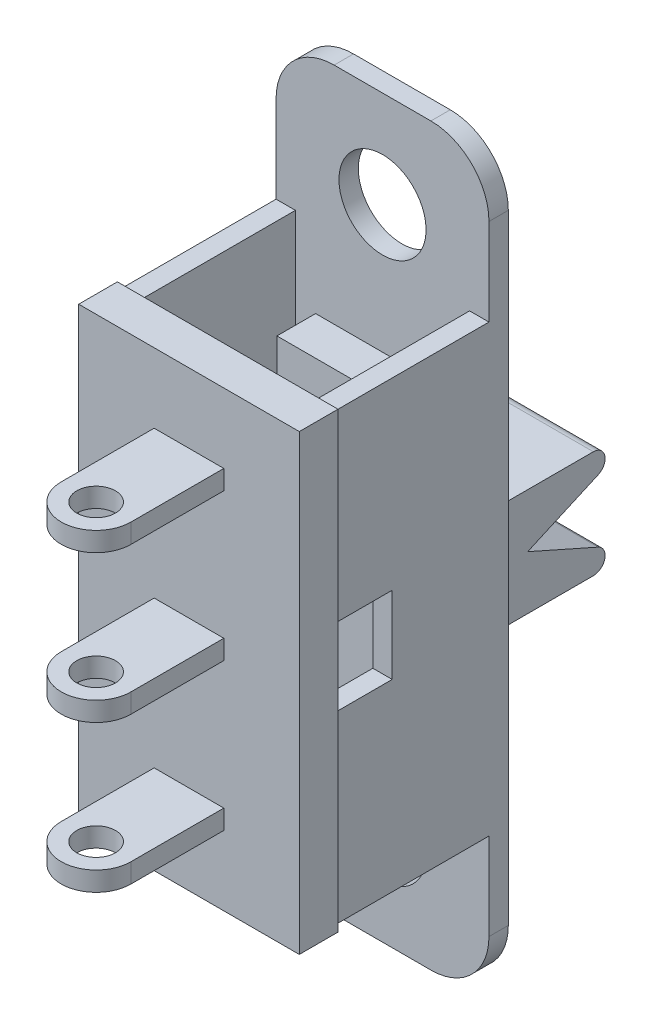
ISO-10303-21;
HEADER;
FILE_DESCRIPTION(('STEP AP214'),'2;1');
FILE_NAME('part.step','',(''),(''),'','','');
FILE_SCHEMA(('AUTOMOTIVE_DESIGN { 1 0 10303 214 1 1 1 1 }'));
ENDSEC;
DATA;
#1=APPLICATION_CONTEXT('core data for automotive mechanical design processes');
#2=APPLICATION_PROTOCOL_DEFINITION('international standard','automotive_design',2000,#1);
#3=PRODUCT_CONTEXT('',#1,'mechanical');
#4=PRODUCT('Part','Part','',(#3));
#5=PRODUCT_RELATED_PRODUCT_CATEGORY('part','',(#4));
#6=PRODUCT_DEFINITION_FORMATION('','',#4);
#7=PRODUCT_DEFINITION_CONTEXT('part definition',#1,'design');
#8=PRODUCT_DEFINITION('design','',#6,#7);
#9=PRODUCT_DEFINITION_SHAPE('','',#8);
#10=(LENGTH_UNIT() NAMED_UNIT(*) SI_UNIT(.MILLI.,.METRE.));
#11=(NAMED_UNIT(*) PLANE_ANGLE_UNIT() SI_UNIT($,.RADIAN.));
#12=(NAMED_UNIT(*) SI_UNIT($,.STERADIAN.) SOLID_ANGLE_UNIT());
#13=UNCERTAINTY_MEASURE_WITH_UNIT(LENGTH_MEASURE(1.E-05),#10,'distance_accuracy_value','');
#14=(GEOMETRIC_REPRESENTATION_CONTEXT(3) GLOBAL_UNCERTAINTY_ASSIGNED_CONTEXT((#13)) GLOBAL_UNIT_ASSIGNED_CONTEXT((#10,
#11,#12)) REPRESENTATION_CONTEXT('',''));
#15=CARTESIAN_POINT('',(0.,0.,0.));
#16=DIRECTION('',(0.,0.,1.));
#17=DIRECTION('',(1.,0.,0.));
#18=AXIS2_PLACEMENT_3D('',#15,#16,#17);
#19=CARTESIAN_POINT('',(2.75,-0.24999999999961,7.4));
#20=DIRECTION('',(0.,1.,0.));
#21=DIRECTION('',(0.,0.,1.));
#22=AXIS2_PLACEMENT_3D('',#19,#20,#21);
#23=CYLINDRICAL_SURFACE('',#22,0.5);
#24=CARTESIAN_POINT('',(2.75,-0.24999999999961,7.4));
#25=DIRECTION('',(0.,1.,0.));
#26=DIRECTION('',(0.,0.,1.));
#27=AXIS2_PLACEMENT_3D('',#24,#25,#26);
#28=CIRCLE('',#27,0.5);
#29=CARTESIAN_POINT('',(2.75,-0.24999999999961,7.9));
#30=VERTEX_POINT('',#29);
#31=EDGE_CURVE('E306',#30,#30,#28,.T.);
#32=ORIENTED_EDGE('',*,*,#31,.F.);
#33=EDGE_LOOP('',(#32));
#34=FACE_BOUND('',#33,.T.);
#35=CARTESIAN_POINT('',(2.75,0.249999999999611,7.4));
#36=DIRECTION('',(0.,1.,0.));
#37=DIRECTION('',(0.,0.,1.));
#38=AXIS2_PLACEMENT_3D('',#35,#36,#37);
#39=CIRCLE('',#38,0.5);
#40=CARTESIAN_POINT('',(2.75,0.249999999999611,7.9));
#41=VERTEX_POINT('',#40);
#42=EDGE_CURVE('E315',#41,#41,#39,.F.);
#43=ORIENTED_EDGE('',*,*,#42,.F.);
#44=EDGE_LOOP('',(#43));
#45=FACE_BOUND('',#44,.T.);
#46=ADVANCED_FACE('F16',(#34,#45),#23,.F.);
#47=CARTESIAN_POINT('',(2.75,0.250000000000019,7.4));
#48=DIRECTION('',(0.,-1.,0.));
#49=DIRECTION('',(0.,0.,-1.));
#50=AXIS2_PLACEMENT_3D('',#47,#48,#49);
#51=CYLINDRICAL_SURFACE('',#50,0.9);
#52=DIRECTION('',(0.,-1.,0.));
#53=VECTOR('',#52,1.);
#54=CARTESIAN_POINT('',(3.65,0.,7.4));
#55=LINE('',#54,#53);
#56=CARTESIAN_POINT('',(3.65,0.250000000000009,7.4));
#57=VERTEX_POINT('',#56);
#58=CARTESIAN_POINT('',(3.65,-0.250000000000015,7.4));
#59=VERTEX_POINT('',#58);
#60=EDGE_CURVE('E311',#57,#59,#55,.T.);
#61=ORIENTED_EDGE('',*,*,#60,.F.);
#62=CARTESIAN_POINT('',(2.75,0.250000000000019,7.4));
#63=DIRECTION('',(0.,-1.,0.));
#64=DIRECTION('',(0.,0.,-1.));
#65=AXIS2_PLACEMENT_3D('',#62,#63,#64);
#66=CIRCLE('',#65,0.9);
#67=CARTESIAN_POINT('',(1.85,0.250000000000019,7.4));
#68=VERTEX_POINT('',#67);
#69=EDGE_CURVE('E20',#68,#57,#66,.F.);
#70=ORIENTED_EDGE('',*,*,#69,.F.);
#71=DIRECTION('',(0.,1.,0.));
#72=VECTOR('',#71,1.);
#73=CARTESIAN_POINT('',(1.85,0.,7.4));
#74=LINE('',#73,#72);
#75=CARTESIAN_POINT('',(1.85,-0.250000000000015,7.4));
#76=VERTEX_POINT('',#75);
#77=EDGE_CURVE('E295',#76,#68,#74,.T.);
#78=ORIENTED_EDGE('',*,*,#77,.F.);
#79=CARTESIAN_POINT('',(2.75,-0.25000000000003,7.4));
#80=DIRECTION('',(0.,-1.,0.));
#81=DIRECTION('',(0.,0.,-1.));
#82=AXIS2_PLACEMENT_3D('',#79,#80,#81);
#83=CIRCLE('',#82,0.9);
#84=EDGE_CURVE('E340',#59,#76,#83,.T.);
#85=ORIENTED_EDGE('',*,*,#84,.F.);
#86=EDGE_LOOP('',(#61,#70,#78,#85));
#87=FACE_BOUND('',#86,.T.);
#88=ADVANCED_FACE('F310',(#87),#51,.T.);
#89=CARTESIAN_POINT('',(2.75,3.54999999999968,7.4));
#90=DIRECTION('',(0.,1.,0.));
#91=DIRECTION('',(0.,0.,1.));
#92=AXIS2_PLACEMENT_3D('',#89,#90,#91);
#93=CYLINDRICAL_SURFACE('',#92,0.5);
#94=CARTESIAN_POINT('',(2.75,3.54999999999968,7.4));
#95=DIRECTION('',(0.,1.,0.));
#96=DIRECTION('',(0.,0.,1.));
#97=AXIS2_PLACEMENT_3D('',#94,#95,#96);
#98=CIRCLE('',#97,0.5);
#99=CARTESIAN_POINT('',(2.75,3.54999999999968,7.9));
#100=VERTEX_POINT('',#99);
#101=EDGE_CURVE('E423',#100,#100,#98,.T.);
#102=ORIENTED_EDGE('',*,*,#101,.F.);
#103=EDGE_LOOP('',(#102));
#104=FACE_BOUND('',#103,.T.);
#105=CARTESIAN_POINT('',(2.75,4.04999999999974,7.4));
#106=DIRECTION('',(0.,1.,0.));
#107=DIRECTION('',(0.,0.,1.));
#108=AXIS2_PLACEMENT_3D('',#105,#106,#107);
#109=CIRCLE('',#108,0.5);
#110=CARTESIAN_POINT('',(2.75,4.04999999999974,7.9));
#111=VERTEX_POINT('',#110);
#112=EDGE_CURVE('E431',#111,#111,#109,.F.);
#113=ORIENTED_EDGE('',*,*,#112,.F.);
#114=EDGE_LOOP('',(#113));
#115=FACE_BOUND('',#114,.T.);
#116=ADVANCED_FACE('F450',(#104,#115),#93,.F.);
#117=CARTESIAN_POINT('',(2.75,4.04999999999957,7.4));
#118=DIRECTION('',(0.,-1.,0.));
#119=DIRECTION('',(0.,0.,-1.));
#120=AXIS2_PLACEMENT_3D('',#117,#118,#119);
#121=CYLINDRICAL_SURFACE('',#120,0.9);
#122=DIRECTION('',(0.,-1.,0.));
#123=VECTOR('',#122,1.);
#124=CARTESIAN_POINT('',(3.65,3.8,7.4));
#125=LINE('',#124,#123);
#126=CARTESIAN_POINT('',(3.65,4.04999999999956,7.4));
#127=VERTEX_POINT('',#126);
#128=CARTESIAN_POINT('',(3.65,3.55000000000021,7.4));
#129=VERTEX_POINT('',#128);
#130=EDGE_CURVE('E434',#127,#129,#125,.T.);
#131=ORIENTED_EDGE('',*,*,#130,.F.);
#132=CARTESIAN_POINT('',(2.75,4.04999999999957,7.4));
#133=DIRECTION('',(0.,-1.,0.));
#134=DIRECTION('',(0.,0.,-1.));
#135=AXIS2_PLACEMENT_3D('',#132,#133,#134);
#136=CIRCLE('',#135,0.9);
#137=CARTESIAN_POINT('',(1.85,4.04999999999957,7.4));
#138=VERTEX_POINT('',#137);
#139=EDGE_CURVE('E320',#138,#127,#136,.F.);
#140=ORIENTED_EDGE('',*,*,#139,.F.);
#141=DIRECTION('',(0.,1.,0.));
#142=VECTOR('',#141,1.);
#143=CARTESIAN_POINT('',(1.85,3.8,7.4));
#144=LINE('',#143,#142);
#145=CARTESIAN_POINT('',(1.85,3.55000000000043,7.4));
#146=VERTEX_POINT('',#145);
#147=EDGE_CURVE('E426',#146,#138,#144,.T.);
#148=ORIENTED_EDGE('',*,*,#147,.F.);
#149=CARTESIAN_POINT('',(2.75,3.55000000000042,7.4));
#150=DIRECTION('',(0.,-1.,0.));
#151=DIRECTION('',(0.,0.,-1.));
#152=AXIS2_PLACEMENT_3D('',#149,#150,#151);
#153=CIRCLE('',#152,0.9);
#154=EDGE_CURVE('E428',#129,#146,#153,.T.);
#155=ORIENTED_EDGE('',*,*,#154,.F.);
#156=EDGE_LOOP('',(#131,#140,#148,#155));
#157=FACE_BOUND('',#156,.T.);
#158=ADVANCED_FACE('F1566',(#157),#121,.T.);
#159=CARTESIAN_POINT('',(2.75,-4.04999999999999,7.4));
#160=DIRECTION('',(0.,1.,0.));
#161=DIRECTION('',(0.,0.,1.));
#162=AXIS2_PLACEMENT_3D('',#159,#160,#161);
#163=CYLINDRICAL_SURFACE('',#162,0.5);
#164=CARTESIAN_POINT('',(2.75,-4.04999999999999,7.4));
#165=DIRECTION('',(0.,1.,0.));
#166=DIRECTION('',(0.,0.,1.));
#167=AXIS2_PLACEMENT_3D('',#164,#165,#166);
#168=CIRCLE('',#167,0.5);
#169=CARTESIAN_POINT('',(2.75,-4.04999999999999,7.9));
#170=VERTEX_POINT('',#169);
#171=EDGE_CURVE('E408',#170,#170,#168,.T.);
#172=ORIENTED_EDGE('',*,*,#171,.F.);
#173=EDGE_LOOP('',(#172));
#174=FACE_BOUND('',#173,.T.);
#175=CARTESIAN_POINT('',(2.75,-3.55000000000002,7.4));
#176=DIRECTION('',(0.,1.,0.));
#177=DIRECTION('',(0.,0.,1.));
#178=AXIS2_PLACEMENT_3D('',#175,#176,#177);
#179=CIRCLE('',#178,0.5);
#180=CARTESIAN_POINT('',(2.75,-3.55000000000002,7.9));
#181=VERTEX_POINT('',#180);
#182=EDGE_CURVE('E416',#181,#181,#179,.F.);
#183=ORIENTED_EDGE('',*,*,#182,.F.);
#184=EDGE_LOOP('',(#183));
#185=FACE_BOUND('',#184,.T.);
#186=ADVANCED_FACE('F1558',(#174,#185),#163,.F.);
#187=CARTESIAN_POINT('',(2.75,-3.55000000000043,7.4));
#188=DIRECTION('',(0.,-1.,0.));
#189=DIRECTION('',(0.,0.,-1.));
#190=AXIS2_PLACEMENT_3D('',#187,#188,#189);
#191=CYLINDRICAL_SURFACE('',#190,0.9);
#192=DIRECTION('',(0.,-1.,0.));
#193=VECTOR('',#192,1.);
#194=CARTESIAN_POINT('',(3.65,-3.8,7.4));
#195=LINE('',#194,#193);
#196=CARTESIAN_POINT('',(3.65,-3.55000000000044,7.4));
#197=VERTEX_POINT('',#196);
#198=CARTESIAN_POINT('',(3.65,-4.04999999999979,7.4));
#199=VERTEX_POINT('',#198);
#200=EDGE_CURVE('E419',#197,#199,#195,.T.);
#201=ORIENTED_EDGE('',*,*,#200,.F.);
#202=CARTESIAN_POINT('',(2.75,-3.55000000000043,7.4));
#203=DIRECTION('',(0.,-1.,0.));
#204=DIRECTION('',(0.,0.,-1.));
#205=AXIS2_PLACEMENT_3D('',#202,#203,#204);
#206=CIRCLE('',#205,0.9);
#207=CARTESIAN_POINT('',(1.85,-3.55000000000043,7.4));
#208=VERTEX_POINT('',#207);
#209=EDGE_CURVE('E420',#208,#197,#206,.F.);
#210=ORIENTED_EDGE('',*,*,#209,.F.);
#211=DIRECTION('',(0.,1.,0.));
#212=VECTOR('',#211,1.);
#213=CARTESIAN_POINT('',(1.85,-3.8,7.4));
#214=LINE('',#213,#212);
#215=CARTESIAN_POINT('',(1.85,-4.04999999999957,7.4));
#216=VERTEX_POINT('',#215);
#217=EDGE_CURVE('E411',#216,#208,#214,.T.);
#218=ORIENTED_EDGE('',*,*,#217,.F.);
#219=CARTESIAN_POINT('',(2.75,-4.04999999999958,7.4));
#220=DIRECTION('',(0.,-1.,0.));
#221=DIRECTION('',(0.,0.,-1.));
#222=AXIS2_PLACEMENT_3D('',#219,#220,#221);
#223=CIRCLE('',#222,0.9);
#224=EDGE_CURVE('E413',#199,#216,#223,.T.);
#225=ORIENTED_EDGE('',*,*,#224,.F.);
#226=EDGE_LOOP('',(#201,#210,#218,#225));
#227=FACE_BOUND('',#226,.T.);
#228=ADVANCED_FACE('F1240',(#227),#191,.T.);
#229=CARTESIAN_POINT('',(3.686,0.25,4.933963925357));
#230=DIRECTION('',(0.,1.,0.));
#231=DIRECTION('',(-1.,0.,0.));
#232=AXIS2_PLACEMENT_3D('',#229,#230,#231);
#233=PLANE('',#232);
#234=ORIENTED_EDGE('',*,*,#42,.T.);
#235=EDGE_LOOP('',(#234));
#236=FACE_BOUND('',#235,.T.);
#237=DIRECTION('',(1.,0.,0.));
#238=VECTOR('',#237,1.);
#239=CARTESIAN_POINT('',(2.75,0.25,5.));
#240=LINE('',#239,#238);
#241=CARTESIAN_POINT('',(1.85,0.25000000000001,5.));
#242=VERTEX_POINT('',#241);
#243=CARTESIAN_POINT('',(3.65,0.25,5.));
#244=VERTEX_POINT('',#243);
#245=EDGE_CURVE('E318',#242,#244,#240,.T.);
#246=ORIENTED_EDGE('',*,*,#245,.F.);
#247=DIRECTION('',(0.,0.,-1.));
#248=VECTOR('',#247,1.);
#249=CARTESIAN_POINT('',(1.85,0.250000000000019,6.2));
#250=LINE('',#249,#248);
#251=EDGE_CURVE('E300',#68,#242,#250,.T.);
#252=ORIENTED_EDGE('',*,*,#251,.F.);
#253=ORIENTED_EDGE('',*,*,#69,.T.);
#254=DIRECTION('',(0.,0.,1.));
#255=VECTOR('',#254,1.);
#256=CARTESIAN_POINT('',(3.65,0.249999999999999,6.2));
#257=LINE('',#256,#255);
#258=EDGE_CURVE('E334',#244,#57,#257,.T.);
#259=ORIENTED_EDGE('',*,*,#258,.F.);
#260=EDGE_LOOP('',(#246,#252,#253,#259));
#261=FACE_BOUND('',#260,.T.);
#262=ADVANCED_FACE('F317',(#236,#261),#233,.T.);
#263=CARTESIAN_POINT('',(3.65,-0.2783306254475,4.952));
#264=DIRECTION('',(1.,0.,0.));
#265=DIRECTION('',(0.,1.,0.));
#266=AXIS2_PLACEMENT_3D('',#263,#264,#265);
#267=PLANE('',#266);
#268=DIRECTION('',(0.,-1.,0.));
#269=VECTOR('',#268,1.);
#270=CARTESIAN_POINT('',(3.65,0.,5.));
#271=LINE('',#270,#269);
#272=CARTESIAN_POINT('',(3.65,-0.25,4.99999999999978));
#273=VERTEX_POINT('',#272);
#274=EDGE_CURVE('E329',#244,#273,#271,.T.);
#275=ORIENTED_EDGE('',*,*,#274,.F.);
#276=ORIENTED_EDGE('',*,*,#258,.T.);
#277=ORIENTED_EDGE('',*,*,#60,.T.);
#278=DIRECTION('',(0.,0.,1.));
#279=VECTOR('',#278,1.);
#280=CARTESIAN_POINT('',(3.65,-0.25,6.6509018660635));
#281=LINE('',#280,#279);
#282=EDGE_CURVE('E438',#273,#59,#281,.T.);
#283=ORIENTED_EDGE('',*,*,#282,.F.);
#284=EDGE_LOOP('',(#275,#276,#277,#283));
#285=FACE_BOUND('',#284,.T.);
#286=ADVANCED_FACE('F1239',(#285),#267,.T.);
#287=CARTESIAN_POINT('',(1.814,-0.25,4.933963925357));
#288=DIRECTION('',(0.,-1.,0.));
#289=DIRECTION('',(1.,0.,0.));
#290=AXIS2_PLACEMENT_3D('',#287,#288,#289);
#291=PLANE('',#290);
#292=ORIENTED_EDGE('',*,*,#31,.T.);
#293=EDGE_LOOP('',(#292));
#294=FACE_BOUND('',#293,.T.);
#295=DIRECTION('',(-1.,0.,0.));
#296=VECTOR('',#295,1.);
#297=CARTESIAN_POINT('',(2.75,-0.25,5.));
#298=LINE('',#297,#296);
#299=CARTESIAN_POINT('',(1.85,-0.249999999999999,5.));
#300=VERTEX_POINT('',#299);
#301=EDGE_CURVE('E336',#273,#300,#298,.T.);
#302=ORIENTED_EDGE('',*,*,#301,.F.);
#303=ORIENTED_EDGE('',*,*,#282,.T.);
#304=ORIENTED_EDGE('',*,*,#84,.T.);
#305=DIRECTION('',(0.,0.,1.));
#306=VECTOR('',#305,1.);
#307=CARTESIAN_POINT('',(1.85,-0.249999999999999,6.2));
#308=LINE('',#307,#306);
#309=EDGE_CURVE('E303',#300,#76,#308,.T.);
#310=ORIENTED_EDGE('',*,*,#309,.F.);
#311=EDGE_LOOP('',(#302,#303,#304,#310));
#312=FACE_BOUND('',#311,.T.);
#313=ADVANCED_FACE('F833',(#294,#312),#291,.T.);
#314=CARTESIAN_POINT('',(1.85,0.2783306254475,4.952));
#315=DIRECTION('',(-1.,0.,0.));
#316=DIRECTION('',(0.,-1.,0.));
#317=AXIS2_PLACEMENT_3D('',#314,#315,#316);
#318=PLANE('',#317);
#319=DIRECTION('',(0.,1.,0.));
#320=VECTOR('',#319,1.);
#321=CARTESIAN_POINT('',(1.85,0.,5.));
#322=LINE('',#321,#320);
#323=EDGE_CURVE('E810',#300,#242,#322,.T.);
#324=ORIENTED_EDGE('',*,*,#323,.F.);
#325=ORIENTED_EDGE('',*,*,#309,.T.);
#326=ORIENTED_EDGE('',*,*,#77,.T.);
#327=ORIENTED_EDGE('',*,*,#251,.T.);
#328=EDGE_LOOP('',(#324,#325,#326,#327));
#329=FACE_BOUND('',#328,.T.);
#330=ADVANCED_FACE('F298',(#329),#318,.T.);
#331=CARTESIAN_POINT('',(3.686,4.05,4.933963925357));
#332=DIRECTION('',(0.,1.,0.));
#333=DIRECTION('',(-1.,0.,0.));
#334=AXIS2_PLACEMENT_3D('',#331,#332,#333);
#335=PLANE('',#334);
#336=ORIENTED_EDGE('',*,*,#112,.T.);
#337=EDGE_LOOP('',(#336));
#338=FACE_BOUND('',#337,.T.);
#339=DIRECTION('',(1.,0.,0.));
#340=VECTOR('',#339,1.);
#341=CARTESIAN_POINT('',(2.75,4.05,5.));
#342=LINE('',#341,#340);
#343=CARTESIAN_POINT('',(1.85,4.04999999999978,5.));
#344=VERTEX_POINT('',#343);
#345=CARTESIAN_POINT('',(3.65,4.04999999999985,5.));
#346=VERTEX_POINT('',#345);
#347=EDGE_CURVE('E808',#344,#346,#342,.T.);
#348=ORIENTED_EDGE('',*,*,#347,.F.);
#349=DIRECTION('',(0.,0.,-1.));
#350=VECTOR('',#349,1.);
#351=CARTESIAN_POINT('',(1.85,4.04999999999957,6.2));
#352=LINE('',#351,#350);
#353=EDGE_CURVE('E791',#138,#344,#352,.T.);
#354=ORIENTED_EDGE('',*,*,#353,.F.);
#355=ORIENTED_EDGE('',*,*,#139,.T.);
#356=DIRECTION('',(0.,0.,1.));
#357=VECTOR('',#356,1.);
#358=CARTESIAN_POINT('',(3.65,4.04999999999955,6.2));
#359=LINE('',#358,#357);
#360=EDGE_CURVE('E430',#346,#127,#359,.T.);
#361=ORIENTED_EDGE('',*,*,#360,.F.);
#362=EDGE_LOOP('',(#348,#354,#355,#361));
#363=FACE_BOUND('',#362,.T.);
#364=ADVANCED_FACE('F1261',(#338,#363),#335,.T.);
#365=CARTESIAN_POINT('',(3.65,3.521669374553,4.952));
#366=DIRECTION('',(1.,0.,0.));
#367=DIRECTION('',(0.,1.,0.));
#368=AXIS2_PLACEMENT_3D('',#365,#366,#367);
#369=PLANE('',#368);
#370=DIRECTION('',(0.,-1.,0.));
#371=VECTOR('',#370,1.);
#372=CARTESIAN_POINT('',(3.65,0.,5.));
#373=LINE('',#372,#371);
#374=CARTESIAN_POINT('',(3.65,3.55,4.99999999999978));
#375=VERTEX_POINT('',#374);
#376=EDGE_CURVE('E798',#346,#375,#373,.T.);
#377=ORIENTED_EDGE('',*,*,#376,.F.);
#378=ORIENTED_EDGE('',*,*,#360,.T.);
#379=ORIENTED_EDGE('',*,*,#130,.T.);
#380=DIRECTION('',(0.,0.,1.));
#381=VECTOR('',#380,1.);
#382=CARTESIAN_POINT('',(3.65,3.55,6.6509018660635));
#383=LINE('',#382,#381);
#384=EDGE_CURVE('E427',#375,#129,#383,.T.);
#385=ORIENTED_EDGE('',*,*,#384,.F.);
#386=EDGE_LOOP('',(#377,#378,#379,#385));
#387=FACE_BOUND('',#386,.T.);
#388=ADVANCED_FACE('F1268',(#387),#369,.T.);
#389=CARTESIAN_POINT('',(1.814,3.55,4.933963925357));
#390=DIRECTION('',(0.,-1.,0.));
#391=DIRECTION('',(1.,0.,0.));
#392=AXIS2_PLACEMENT_3D('',#389,#390,#391);
#393=PLANE('',#392);
#394=ORIENTED_EDGE('',*,*,#101,.T.);
#395=EDGE_LOOP('',(#394));
#396=FACE_BOUND('',#395,.T.);
#397=DIRECTION('',(-1.,0.,0.));
#398=VECTOR('',#397,1.);
#399=CARTESIAN_POINT('',(2.75,3.55,5.));
#400=LINE('',#399,#398);
#401=CARTESIAN_POINT('',(1.85,3.55000000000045,5.));
#402=VERTEX_POINT('',#401);
#403=EDGE_CURVE('E796',#375,#402,#400,.T.);
#404=ORIENTED_EDGE('',*,*,#403,.F.);
#405=ORIENTED_EDGE('',*,*,#384,.T.);
#406=ORIENTED_EDGE('',*,*,#154,.T.);
#407=DIRECTION('',(0.,0.,1.));
#408=VECTOR('',#407,1.);
#409=CARTESIAN_POINT('',(1.85,3.55000000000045,6.2));
#410=LINE('',#409,#408);
#411=EDGE_CURVE('E422',#402,#146,#410,.T.);
#412=ORIENTED_EDGE('',*,*,#411,.F.);
#413=EDGE_LOOP('',(#404,#405,#406,#412));
#414=FACE_BOUND('',#413,.T.);
#415=ADVANCED_FACE('F1276',(#396,#414),#393,.T.);
#416=CARTESIAN_POINT('',(1.85,4.078330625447,4.952));
#417=DIRECTION('',(-1.,0.,0.));
#418=DIRECTION('',(0.,-1.,0.));
#419=AXIS2_PLACEMENT_3D('',#416,#417,#418);
#420=PLANE('',#419);
#421=DIRECTION('',(0.,1.,0.));
#422=VECTOR('',#421,1.);
#423=CARTESIAN_POINT('',(1.85,0.,5.));
#424=LINE('',#423,#422);
#425=EDGE_CURVE('E779',#402,#344,#424,.T.);
#426=ORIENTED_EDGE('',*,*,#425,.F.);
#427=ORIENTED_EDGE('',*,*,#411,.T.);
#428=ORIENTED_EDGE('',*,*,#147,.T.);
#429=ORIENTED_EDGE('',*,*,#353,.T.);
#430=EDGE_LOOP('',(#426,#427,#428,#429));
#431=FACE_BOUND('',#430,.T.);
#432=ADVANCED_FACE('F1284',(#431),#420,.T.);
#433=CARTESIAN_POINT('',(3.686,-3.55,4.933963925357));
#434=DIRECTION('',(0.,1.,0.));
#435=DIRECTION('',(-1.,0.,0.));
#436=AXIS2_PLACEMENT_3D('',#433,#434,#435);
#437=PLANE('',#436);
#438=ORIENTED_EDGE('',*,*,#182,.T.);
#439=EDGE_LOOP('',(#438));
#440=FACE_BOUND('',#439,.T.);
#441=DIRECTION('',(1.,0.,0.));
#442=VECTOR('',#441,1.);
#443=CARTESIAN_POINT('',(2.75,-3.55,5.));
#444=LINE('',#443,#442);
#445=CARTESIAN_POINT('',(1.85,-3.55000000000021,5.));
#446=VERTEX_POINT('',#445);
#447=CARTESIAN_POINT('',(3.65,-3.55000000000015,5.));
#448=VERTEX_POINT('',#447);
#449=EDGE_CURVE('E777',#446,#448,#444,.T.);
#450=ORIENTED_EDGE('',*,*,#449,.F.);
#451=DIRECTION('',(0.,0.,-1.));
#452=VECTOR('',#451,1.);
#453=CARTESIAN_POINT('',(1.85,-3.55000000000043,6.2));
#454=LINE('',#453,#452);
#455=EDGE_CURVE('E760',#208,#446,#454,.T.);
#456=ORIENTED_EDGE('',*,*,#455,.F.);
#457=ORIENTED_EDGE('',*,*,#209,.T.);
#458=DIRECTION('',(0.,0.,1.));
#459=VECTOR('',#458,1.);
#460=CARTESIAN_POINT('',(3.65,-3.55000000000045,6.2));
#461=LINE('',#460,#459);
#462=EDGE_CURVE('E415',#448,#197,#461,.T.);
#463=ORIENTED_EDGE('',*,*,#462,.F.);
#464=EDGE_LOOP('',(#450,#456,#457,#463));
#465=FACE_BOUND('',#464,.T.);
#466=ADVANCED_FACE('F1292',(#440,#465),#437,.T.);
#467=CARTESIAN_POINT('',(3.65,-4.078330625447,4.952));
#468=DIRECTION('',(1.,0.,0.));
#469=DIRECTION('',(0.,1.,0.));
#470=AXIS2_PLACEMENT_3D('',#467,#468,#469);
#471=PLANE('',#470);
#472=DIRECTION('',(0.,-1.,0.));
#473=VECTOR('',#472,1.);
#474=CARTESIAN_POINT('',(3.65,0.,5.));
#475=LINE('',#474,#473);
#476=CARTESIAN_POINT('',(3.65,-4.05,4.99999999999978));
#477=VERTEX_POINT('',#476);
#478=EDGE_CURVE('E767',#448,#477,#475,.T.);
#479=ORIENTED_EDGE('',*,*,#478,.F.);
#480=ORIENTED_EDGE('',*,*,#462,.T.);
#481=ORIENTED_EDGE('',*,*,#200,.T.);
#482=DIRECTION('',(0.,0.,1.));
#483=VECTOR('',#482,1.);
#484=CARTESIAN_POINT('',(3.65,-4.05,6.6509018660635));
#485=LINE('',#484,#483);
#486=EDGE_CURVE('E412',#477,#199,#485,.T.);
#487=ORIENTED_EDGE('',*,*,#486,.F.);
#488=EDGE_LOOP('',(#479,#480,#481,#487));
#489=FACE_BOUND('',#488,.T.);
#490=ADVANCED_FACE('F1300',(#489),#471,.T.);
#491=CARTESIAN_POINT('',(1.814,-4.05,4.933963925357));
#492=DIRECTION('',(0.,-1.,0.));
#493=DIRECTION('',(1.,0.,0.));
#494=AXIS2_PLACEMENT_3D('',#491,#492,#493);
#495=PLANE('',#494);
#496=ORIENTED_EDGE('',*,*,#171,.T.);
#497=EDGE_LOOP('',(#496));
#498=FACE_BOUND('',#497,.T.);
#499=DIRECTION('',(-1.,0.,0.));
#500=VECTOR('',#499,1.);
#501=CARTESIAN_POINT('',(2.75,-4.05,5.));
#502=LINE('',#501,#500);
#503=CARTESIAN_POINT('',(1.85,-4.04999999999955,5.));
#504=VERTEX_POINT('',#503);
#505=EDGE_CURVE('E765',#477,#504,#502,.T.);
#506=ORIENTED_EDGE('',*,*,#505,.F.);
#507=ORIENTED_EDGE('',*,*,#486,.T.);
#508=ORIENTED_EDGE('',*,*,#224,.T.);
#509=DIRECTION('',(0.,0.,1.));
#510=VECTOR('',#509,1.);
#511=CARTESIAN_POINT('',(1.85,-4.04999999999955,6.2));
#512=LINE('',#511,#510);
#513=EDGE_CURVE('E705',#504,#216,#512,.T.);
#514=ORIENTED_EDGE('',*,*,#513,.F.);
#515=EDGE_LOOP('',(#506,#507,#508,#514));
#516=FACE_BOUND('',#515,.T.);
#517=ADVANCED_FACE('F1308',(#498,#516),#495,.T.);
#518=CARTESIAN_POINT('',(1.85,-3.521669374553,4.952));
#519=DIRECTION('',(-1.,0.,0.));
#520=DIRECTION('',(0.,-1.,0.));
#521=AXIS2_PLACEMENT_3D('',#518,#519,#520);
#522=PLANE('',#521);
#523=DIRECTION('',(0.,1.,0.));
#524=VECTOR('',#523,1.);
#525=CARTESIAN_POINT('',(1.85,0.,5.));
#526=LINE('',#525,#524);
#527=EDGE_CURVE('E738',#504,#446,#526,.T.);
#528=ORIENTED_EDGE('',*,*,#527,.F.);
#529=ORIENTED_EDGE('',*,*,#513,.T.);
#530=ORIENTED_EDGE('',*,*,#217,.T.);
#531=ORIENTED_EDGE('',*,*,#455,.T.);
#532=EDGE_LOOP('',(#528,#529,#530,#531));
#533=FACE_BOUND('',#532,.T.);
#534=ADVANCED_FACE('F1316',(#533),#522,.T.);
#535=CARTESIAN_POINT('',(4.05,-3.12,0.));
#536=DIRECTION('',(0.,0.,1.));
#537=DIRECTION('',(0.,1.,0.));
#538=AXIS2_PLACEMENT_3D('',#535,#536,#537);
#539=PLANE('',#538);
#540=DIRECTION('',(-1.,0.,0.));
#541=VECTOR('',#540,1.);
#542=CARTESIAN_POINT('',(2.75,-3.,0.));
#543=LINE('',#542,#541);
#544=CARTESIAN_POINT('',(4.,-3.,0.));
#545=VERTEX_POINT('',#544);
#546=CARTESIAN_POINT('',(1.5,-3.,0.));
#547=VERTEX_POINT('',#546);
#548=EDGE_CURVE('E756',#545,#547,#543,.T.);
#549=ORIENTED_EDGE('',*,*,#548,.T.);
#550=DIRECTION('',(0.,1.,0.));
#551=VECTOR('',#550,1.);
#552=CARTESIAN_POINT('',(1.5,0.,0.));
#553=LINE('',#552,#551);
#554=CARTESIAN_POINT('',(1.5,-2.77540601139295,0.));
#555=VERTEX_POINT('',#554);
#556=EDGE_CURVE('E723',#547,#555,#553,.T.);
#557=ORIENTED_EDGE('',*,*,#556,.T.);
#558=DIRECTION('',(-1.,0.,0.));
#559=VECTOR('',#558,1.);
#560=CARTESIAN_POINT('',(2.75,-2.775406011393,0.));
#561=LINE('',#560,#559);
#562=CARTESIAN_POINT('',(4.,-2.775406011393,0.));
#563=VERTEX_POINT('',#562);
#564=EDGE_CURVE('E663',#563,#555,#561,.T.);
#565=ORIENTED_EDGE('',*,*,#564,.F.);
#566=DIRECTION('',(0.,-1.,0.));
#567=VECTOR('',#566,1.);
#568=CARTESIAN_POINT('',(4.,0.,0.));
#569=LINE('',#568,#567);
#570=EDGE_CURVE('E675',#563,#545,#569,.T.);
#571=ORIENTED_EDGE('',*,*,#570,.T.);
#572=EDGE_LOOP('',(#549,#557,#565,#571));
#573=FACE_BOUND('',#572,.T.);
#574=ADVANCED_FACE('F1324',(#573),#539,.F.);
#575=CARTESIAN_POINT('',(1.5,-2.472417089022,-4.19701107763));
#576=DIRECTION('',(1.,0.,0.));
#577=DIRECTION('',(0.,0.,-1.));
#578=AXIS2_PLACEMENT_3D('',#575,#576,#577);
#579=CYLINDRICAL_SURFACE('',#578,0.302988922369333);
#580=DIRECTION('',(1.,0.,0.));
#581=VECTOR('',#580,1.);
#582=CARTESIAN_POINT('',(2.75,-2.775406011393,-4.19701107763));
#583=LINE('',#582,#581);
#584=CARTESIAN_POINT('',(1.5,-2.775406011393,-4.19701107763));
#585=VERTEX_POINT('',#584);
#586=CARTESIAN_POINT('',(3.99999999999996,-2.775406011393,-4.19701107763));
#587=VERTEX_POINT('',#586);
#588=EDGE_CURVE('E661',#585,#587,#583,.T.);
#589=ORIENTED_EDGE('',*,*,#588,.F.);
#590=CARTESIAN_POINT('',(1.5,-2.472417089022,-4.19701107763));
#591=DIRECTION('',(1.,0.,0.));
#592=DIRECTION('',(0.,0.,-1.));
#593=AXIS2_PLACEMENT_3D('',#590,#591,#592);
#594=CIRCLE('',#593,0.302988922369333);
#595=CARTESIAN_POINT('',(1.5,-2.19548140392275,-4.31992939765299));
#596=VERTEX_POINT('',#595);
#597=EDGE_CURVE('E403',#585,#596,#594,.T.);
#598=ORIENTED_EDGE('',*,*,#597,.T.);
#599=DIRECTION('',(-1.,0.,0.));
#600=VECTOR('',#599,1.);
#601=CARTESIAN_POINT('',(2.75,-2.1954814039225,-4.31992939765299));
#602=LINE('',#601,#600);
#603=CARTESIAN_POINT('',(3.99999999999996,-2.19548140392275,-4.319929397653));
#604=VERTEX_POINT('',#603);
#605=EDGE_CURVE('E701',#604,#596,#602,.T.);
#606=ORIENTED_EDGE('',*,*,#605,.F.);
#607=CARTESIAN_POINT('',(3.99999999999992,-2.472417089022,-4.19701107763));
#608=DIRECTION('',(1.,0.,0.));
#609=DIRECTION('',(0.,0.,-1.));
#610=AXIS2_PLACEMENT_3D('',#607,#608,#609);
#611=CIRCLE('',#610,0.302988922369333);
#612=EDGE_CURVE('E394',#587,#604,#611,.T.);
#613=ORIENTED_EDGE('',*,*,#612,.F.);
#614=EDGE_LOOP('',(#589,#598,#606,#613));
#615=FACE_BOUND('',#614,.T.);
#616=ADVANCED_FACE('F1332',(#615),#579,.T.);
#617=CARTESIAN_POINT('',(1.45,-2.211636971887,-4.356327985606));
#618=DIRECTION('',(0.,0.914012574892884,-0.405685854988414));
#619=DIRECTION('',(0.,0.405685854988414,0.914012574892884));
#620=AXIS2_PLACEMENT_3D('',#617,#618,#619);
#621=PLANE('',#620);
#622=DIRECTION('',(-1.,0.,0.));
#623=VECTOR('',#622,1.);
#624=CARTESIAN_POINT('',(2.75,-1.38770300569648,-2.50000000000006));
#625=LINE('',#624,#623);
#626=CARTESIAN_POINT('',(4.,-1.38770300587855,-2.50000000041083));
#627=VERTEX_POINT('',#626);
#628=CARTESIAN_POINT('',(1.5,-1.38770300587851,-2.50000000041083));
#629=VERTEX_POINT('',#628);
#630=EDGE_CURVE('E699',#627,#629,#625,.T.);
#631=ORIENTED_EDGE('',*,*,#630,.F.);
#632=CARTESIAN_POINT('',(4.,-2.19548140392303,-4.319929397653));
#633=CARTESIAN_POINT('',(4.,-2.16182397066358,-4.24409900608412));
#634=CARTESIAN_POINT('',(4.,-2.12816653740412,-4.16826861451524));
#635=CARTESIAN_POINT('',(4.,-2.0608516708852,-4.01660783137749));
#636=CARTESIAN_POINT('',(4.,-2.02719423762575,-3.94077743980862));
#637=CARTESIAN_POINT('',(4.,-1.95987937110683,-3.78911665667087));
#638=CARTESIAN_POINT('',(4.,-1.92622193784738,-3.71328626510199));
#639=CARTESIAN_POINT('',(4.,-1.85890707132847,-3.56162548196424));
#640=CARTESIAN_POINT('',(4.,-1.82524963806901,-3.48579509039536));
#641=CARTESIAN_POINT('',(4.,-1.75793477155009,-3.33413430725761));
#642=CARTESIAN_POINT('',(4.,-1.72427733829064,-3.25830391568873));
#643=CARTESIAN_POINT('',(4.,-1.65696247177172,-3.10664313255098));
#644=CARTESIAN_POINT('',(4.,-1.62330503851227,-3.03081274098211));
#645=CARTESIAN_POINT('',(4.,-1.55599017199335,-2.87915195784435));
#646=CARTESIAN_POINT('',(4.,-1.5223327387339,-2.80332156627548));
#647=CARTESIAN_POINT('',(4.,-1.45501787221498,-2.65166078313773));
#648=CARTESIAN_POINT('',(4.,-1.42136043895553,-2.57583039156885));
#649=CARTESIAN_POINT('',(4.,-1.38770300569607,-2.49999999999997));
#650=B_SPLINE_CURVE_WITH_KNOTS('',3,(#632,#633,#634,#635,#636,#637,#638,#639,#640,#641,#642,
#643,#644,#645,#646,#647,#648,#649),.UNSPECIFIED.,.F.,.F.,(4,2,2,2,2,2,2,2,4),(0.,
0.248892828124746,0.497785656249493,0.746678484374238,0.995571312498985,1.24446414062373,
1.49335696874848,1.74224979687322,1.99114262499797),.UNSPECIFIED.);
#651=EDGE_CURVE('E396',#604,#627,#650,.T.);
#652=ORIENTED_EDGE('',*,*,#651,.F.);
#653=ORIENTED_EDGE('',*,*,#605,.T.);
#654=CARTESIAN_POINT('',(1.5,-2.195481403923,-4.319929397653));
#655=CARTESIAN_POINT('',(1.5,-2.16182397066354,-4.24409900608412));
#656=CARTESIAN_POINT('',(1.5,-2.12816653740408,-4.16826861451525));
#657=CARTESIAN_POINT('',(1.5,-2.06085167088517,-4.01660783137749));
#658=CARTESIAN_POINT('',(1.5,-2.02719423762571,-3.94077743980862));
#659=CARTESIAN_POINT('',(1.5,-1.95987937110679,-3.78911665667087));
#660=CARTESIAN_POINT('',(1.5,-1.92622193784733,-3.71328626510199));
#661=CARTESIAN_POINT('',(1.5,-1.85890707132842,-3.56162548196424));
#662=CARTESIAN_POINT('',(1.5,-1.82524963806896,-3.48579509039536));
#663=CARTESIAN_POINT('',(1.5,-1.75793477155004,-3.33413430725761));
#664=CARTESIAN_POINT('',(1.5,-1.72427733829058,-3.25830391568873));
#665=CARTESIAN_POINT('',(1.5,-1.65696247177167,-3.10664313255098));
#666=CARTESIAN_POINT('',(1.5,-1.62330503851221,-3.03081274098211));
#667=CARTESIAN_POINT('',(1.5,-1.55599017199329,-2.87915195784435));
#668=CARTESIAN_POINT('',(1.5,-1.52233273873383,-2.80332156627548));
#669=CARTESIAN_POINT('',(1.5,-1.45501787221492,-2.65166078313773));
#670=CARTESIAN_POINT('',(1.5,-1.42136043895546,-2.57583039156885));
#671=CARTESIAN_POINT('',(1.5,-1.387703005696,-2.49999999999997));
#672=B_SPLINE_CURVE_WITH_KNOTS('',3,(#654,#655,#656,#657,#658,#659,#660,#661,#662,#663,#664,
#665,#666,#667,#668,#669,#670,#671),.UNSPECIFIED.,.F.,.F.,(4,2,2,2,2,2,2,2,4),(0.,
0.248892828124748,0.497785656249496,0.746678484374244,0.995571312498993,1.24446414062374,
1.49335696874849,1.74224979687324,1.99114262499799),.UNSPECIFIED.);
#673=EDGE_CURVE('E406',#596,#629,#672,.T.);
#674=ORIENTED_EDGE('',*,*,#673,.T.);
#675=EDGE_LOOP('',(#631,#652,#653,#674));
#676=FACE_BOUND('',#675,.T.);
#677=ADVANCED_FACE('F1337',(#676),#621,.T.);
#678=CARTESIAN_POINT('',(1.45,-1.403858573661,-2.463601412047));
#679=DIRECTION('',(0.,-0.914012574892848,-0.405685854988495));
#680=DIRECTION('',(0.,0.405685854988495,-0.914012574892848));
#681=AXIS2_PLACEMENT_3D('',#678,#679,#680);
#682=PLANE('',#681);
#683=ORIENTED_EDGE('',*,*,#630,.T.);
#684=CARTESIAN_POINT('',(1.5,-1.387703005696,-2.49999999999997));
#685=CARTESIAN_POINT('',(1.5,-1.3540455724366,-2.57583039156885));
#686=CARTESIAN_POINT('',(1.5,-1.32038813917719,-2.65166078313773));
#687=CARTESIAN_POINT('',(1.5,-1.25307327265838,-2.80332156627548));
#688=CARTESIAN_POINT('',(1.5,-1.21941583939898,-2.87915195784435));
#689=CARTESIAN_POINT('',(1.5,-1.15210097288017,-3.03081274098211));
#690=CARTESIAN_POINT('',(1.5,-1.11844353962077,-3.10664313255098));
#691=CARTESIAN_POINT('',(1.5,-1.05112867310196,-3.25830391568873));
#692=CARTESIAN_POINT('',(1.5,-1.01747123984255,-3.33413430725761));
#693=CARTESIAN_POINT('',(1.5,-0.950156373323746,-3.48579509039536));
#694=CARTESIAN_POINT('',(1.5,-0.916498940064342,-3.56162548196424));
#695=CARTESIAN_POINT('',(1.5,-0.849184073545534,-3.71328626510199));
#696=CARTESIAN_POINT('',(1.5,-0.815526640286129,-3.78911665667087));
#697=CARTESIAN_POINT('',(1.5,-0.748211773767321,-3.94077743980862));
#698=CARTESIAN_POINT('',(1.5,-0.714554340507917,-4.01660783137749));
#699=CARTESIAN_POINT('',(1.5,-0.647239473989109,-4.16826861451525));
#700=CARTESIAN_POINT('',(1.5,-0.613582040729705,-4.24409900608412));
#701=CARTESIAN_POINT('',(1.5,-0.5799246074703,-4.319929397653));
#702=B_SPLINE_CURVE_WITH_KNOTS('',3,(#684,#685,#686,#687,#688,#689,#690,#691,#692,#693,#694,
#695,#696,#697,#698,#699,#700,#701),.UNSPECIFIED.,.F.,.F.,(4,2,2,2,2,2,2,2,4),(0.,
0.248892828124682,0.497785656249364,0.746678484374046,0.995571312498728,1.24446414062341,
1.49335696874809,1.74224979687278,1.99114262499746),.UNSPECIFIED.);
#703=CARTESIAN_POINT('',(1.5,-0.579924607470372,-4.31992939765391));
#704=VERTEX_POINT('',#703);
#705=EDGE_CURVE('E402',#629,#704,#702,.T.);
#706=ORIENTED_EDGE('',*,*,#705,.T.);
#707=DIRECTION('',(1.,0.,0.));
#708=VECTOR('',#707,1.);
#709=CARTESIAN_POINT('',(2.75,-0.579924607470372,-4.31992939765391));
#710=LINE('',#709,#708);
#711=CARTESIAN_POINT('',(3.99999999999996,-0.579924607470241,-4.31992939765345));
#712=VERTEX_POINT('',#711);
#713=EDGE_CURVE('E664',#704,#712,#710,.T.);
#714=ORIENTED_EDGE('',*,*,#713,.T.);
#715=CARTESIAN_POINT('',(4.,-1.38770300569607,-2.49999999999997));
#716=CARTESIAN_POINT('',(4.,-1.35404557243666,-2.57583039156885));
#717=CARTESIAN_POINT('',(4.,-1.32038813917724,-2.65166078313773));
#718=CARTESIAN_POINT('',(4.,-1.25307327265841,-2.80332156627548));
#719=CARTESIAN_POINT('',(4.,-1.219415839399,-2.87915195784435));
#720=CARTESIAN_POINT('',(4.,-1.15210097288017,-3.03081274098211));
#721=CARTESIAN_POINT('',(4.,-1.11844353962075,-3.10664313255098));
#722=CARTESIAN_POINT('',(4.,-1.05112867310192,-3.25830391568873));
#723=CARTESIAN_POINT('',(4.,-1.0174712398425,-3.33413430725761));
#724=CARTESIAN_POINT('',(4.,-0.950156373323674,-3.48579509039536));
#725=CARTESIAN_POINT('',(4.,-0.916498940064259,-3.56162548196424));
#726=CARTESIAN_POINT('',(4.,-0.84918407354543,-3.71328626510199));
#727=CARTESIAN_POINT('',(4.,-0.815526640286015,-3.78911665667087));
#728=CARTESIAN_POINT('',(4.,-0.748211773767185,-3.94077743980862));
#729=CARTESIAN_POINT('',(4.,-0.714554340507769,-4.01660783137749));
#730=CARTESIAN_POINT('',(4.,-0.647239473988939,-4.16826861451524));
#731=CARTESIAN_POINT('',(4.,-0.613582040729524,-4.24409900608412));
#732=CARTESIAN_POINT('',(4.,-0.579924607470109,-4.319929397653));
#733=B_SPLINE_CURVE_WITH_KNOTS('',3,(#715,#716,#717,#718,#719,#720,#721,#722,#723,#724,#725,
#726,#727,#728,#729,#730,#731,#732),.UNSPECIFIED.,.F.,.F.,(4,2,2,2,2,2,2,2,4),(0.,
0.248892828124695,0.497785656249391,0.746678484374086,0.995571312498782,1.24446414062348,
1.49335696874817,1.74224979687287,1.99114262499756),.UNSPECIFIED.);
#734=EDGE_CURVE('E393',#627,#712,#733,.T.);
#735=ORIENTED_EDGE('',*,*,#734,.F.);
#736=EDGE_LOOP('',(#683,#706,#714,#735));
#737=FACE_BOUND('',#736,.T.);
#738=ADVANCED_FACE('F1342',(#737),#682,.T.);
#739=CARTESIAN_POINT('',(1.5,-0.3029889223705,-4.19701107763));
#740=DIRECTION('',(1.,0.,0.));
#741=DIRECTION('',(0.,0.,-1.));
#742=AXIS2_PLACEMENT_3D('',#739,#740,#741);
#743=CYLINDRICAL_SURFACE('',#742,0.3029889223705);
#744=ORIENTED_EDGE('',*,*,#713,.F.);
#745=CARTESIAN_POINT('',(1.5,-0.3029889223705,-4.19701107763));
#746=DIRECTION('',(1.,0.,0.));
#747=DIRECTION('',(0.,0.,-1.));
#748=AXIS2_PLACEMENT_3D('',#745,#746,#747);
#749=CIRCLE('',#748,0.3029889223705);
#750=CARTESIAN_POINT('',(1.5,0.,-4.1970110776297));
#751=VERTEX_POINT('',#750);
#752=EDGE_CURVE('E398',#704,#751,#749,.T.);
#753=ORIENTED_EDGE('',*,*,#752,.T.);
#754=DIRECTION('',(-1.,0.,0.));
#755=VECTOR('',#754,1.);
#756=CARTESIAN_POINT('',(2.75,0.,-4.19701107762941));
#757=LINE('',#756,#755);
#758=CARTESIAN_POINT('',(3.99999999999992,0.,-4.1970110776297));
#759=VERTEX_POINT('',#758);
#760=EDGE_CURVE('E684',#759,#751,#757,.T.);
#761=ORIENTED_EDGE('',*,*,#760,.F.);
#762=CARTESIAN_POINT('',(3.99999999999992,-0.3029889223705,-4.19701107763));
#763=DIRECTION('',(1.,0.,0.));
#764=DIRECTION('',(0.,0.,-1.));
#765=AXIS2_PLACEMENT_3D('',#762,#763,#764);
#766=CIRCLE('',#765,0.3029889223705);
#767=EDGE_CURVE('E390',#712,#759,#766,.T.);
#768=ORIENTED_EDGE('',*,*,#767,.F.);
#769=EDGE_LOOP('',(#744,#753,#761,#768));
#770=FACE_BOUND('',#769,.T.);
#771=ADVANCED_FACE('F865',(#770),#743,.T.);
#772=CARTESIAN_POINT('',(1.45,-2.775406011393,0.08394022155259));
#773=DIRECTION('',(0.,-1.,0.));
#774=DIRECTION('',(0.,0.,-1.));
#775=AXIS2_PLACEMENT_3D('',#772,#773,#774);
#776=PLANE('',#775);
#777=DIRECTION('',(0.,0.,-1.));
#778=VECTOR('',#777,1.);
#779=CARTESIAN_POINT('',(1.5,-2.7754060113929,-0.25000000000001));
#780=LINE('',#779,#778);
#781=CARTESIAN_POINT('',(1.5,-2.775406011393,-0.499999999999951));
#782=VERTEX_POINT('',#781);
#783=EDGE_CURVE('E720',#555,#782,#780,.T.);
#784=ORIENTED_EDGE('',*,*,#783,.T.);
#785=DIRECTION('',(0.,0.,-1.));
#786=VECTOR('',#785,1.);
#787=CARTESIAN_POINT('',(1.5,-2.775406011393,-2.5000358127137));
#788=LINE('',#787,#786);
#789=EDGE_CURVE('E724',#782,#585,#788,.T.);
#790=ORIENTED_EDGE('',*,*,#789,.T.);
#791=ORIENTED_EDGE('',*,*,#588,.T.);
#792=DIRECTION('',(0.,0.,-1.));
#793=VECTOR('',#792,1.);
#794=CARTESIAN_POINT('',(4.,-2.775406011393,-2.5000358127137));
#795=LINE('',#794,#793);
#796=CARTESIAN_POINT('',(4.,-2.775406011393,-0.499999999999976));
#797=VERTEX_POINT('',#796);
#798=EDGE_CURVE('E690',#797,#587,#795,.T.);
#799=ORIENTED_EDGE('',*,*,#798,.F.);
#800=DIRECTION('',(0.,0.,1.));
#801=VECTOR('',#800,1.);
#802=CARTESIAN_POINT('',(4.,-2.775406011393,-0.25000000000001));
#803=LINE('',#802,#801);
#804=EDGE_CURVE('E672',#797,#563,#803,.T.);
#805=ORIENTED_EDGE('',*,*,#804,.T.);
#806=ORIENTED_EDGE('',*,*,#564,.T.);
#807=EDGE_LOOP('',(#784,#790,#791,#799,#805,#806));
#808=FACE_BOUND('',#807,.T.);
#809=ADVANCED_FACE('F1354',(#808),#776,.T.);
#810=CARTESIAN_POINT('',(1.45,0.,-4.280951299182));
#811=DIRECTION('',(0.,1.,0.));
#812=DIRECTION('',(0.,0.,1.));
#813=AXIS2_PLACEMENT_3D('',#810,#811,#812);
#814=PLANE('',#813);
#815=DIRECTION('',(0.,0.,-1.));
#816=VECTOR('',#815,1.);
#817=CARTESIAN_POINT('',(4.,0.,-0.25000000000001));
#818=LINE('',#817,#816);
#819=CARTESIAN_POINT('',(4.,0.,0.));
#820=VERTEX_POINT('',#819);
#821=CARTESIAN_POINT('',(4.,0.,-0.499999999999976));
#822=VERTEX_POINT('',#821);
#823=EDGE_CURVE('E686',#820,#822,#818,.T.);
#824=ORIENTED_EDGE('',*,*,#823,.T.);
#825=DIRECTION('',(0.,0.,1.));
#826=VECTOR('',#825,1.);
#827=CARTESIAN_POINT('',(4.,-1.370024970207E-13,-2.5000358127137));
#828=LINE('',#827,#826);
#829=EDGE_CURVE('E392',#759,#822,#828,.T.);
#830=ORIENTED_EDGE('',*,*,#829,.F.);
#831=ORIENTED_EDGE('',*,*,#760,.T.);
#832=DIRECTION('',(0.,0.,1.));
#833=VECTOR('',#832,1.);
#834=CARTESIAN_POINT('',(1.5,0.,-2.5000358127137));
#835=LINE('',#834,#833);
#836=CARTESIAN_POINT('',(1.5,0.,-0.499999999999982));
#837=VERTEX_POINT('',#836);
#838=EDGE_CURVE('E401',#751,#837,#835,.T.);
#839=ORIENTED_EDGE('',*,*,#838,.T.);
#840=DIRECTION('',(0.,0.,1.));
#841=VECTOR('',#840,1.);
#842=CARTESIAN_POINT('',(1.5,0.,-0.25000000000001));
#843=LINE('',#842,#841);
#844=CARTESIAN_POINT('',(1.5,0.,0.));
#845=VERTEX_POINT('',#844);
#846=EDGE_CURVE('E735',#837,#845,#843,.T.);
#847=ORIENTED_EDGE('',*,*,#846,.T.);
#848=DIRECTION('',(1.,0.,0.));
#849=VECTOR('',#848,1.);
#850=CARTESIAN_POINT('',(2.75,0.,0.));
#851=LINE('',#850,#849);
#852=EDGE_CURVE('E330',#845,#820,#851,.T.);
#853=ORIENTED_EDGE('',*,*,#852,.T.);
#854=EDGE_LOOP('',(#824,#830,#831,#839,#847,#853));
#855=FACE_BOUND('',#854,.T.);
#856=ADVANCED_FACE('F1359',(#855),#814,.T.);
#857=CARTESIAN_POINT('',(4.05,-3.12,0.));
#858=DIRECTION('',(0.,0.,1.));
#859=DIRECTION('',(0.,1.,0.));
#860=AXIS2_PLACEMENT_3D('',#857,#858,#859);
#861=PLANE('',#860);
#862=DIRECTION('',(1.,0.,0.));
#863=VECTOR('',#862,1.);
#864=CARTESIAN_POINT('',(2.75,3.,0.));
#865=LINE('',#864,#863);
#866=CARTESIAN_POINT('',(1.5,3.,0.));
#867=VERTEX_POINT('',#866);
#868=CARTESIAN_POINT('',(4.,3.,0.));
#869=VERTEX_POINT('',#868);
#870=EDGE_CURVE('E751',#867,#869,#865,.T.);
#871=ORIENTED_EDGE('',*,*,#870,.T.);
#872=DIRECTION('',(0.,-1.,0.));
#873=VECTOR('',#872,1.);
#874=CARTESIAN_POINT('',(4.,0.,0.));
#875=LINE('',#874,#873);
#876=EDGE_CURVE('E689',#869,#820,#875,.T.);
#877=ORIENTED_EDGE('',*,*,#876,.T.);
#878=ORIENTED_EDGE('',*,*,#852,.F.);
#879=DIRECTION('',(0.,1.,0.));
#880=VECTOR('',#879,1.);
#881=CARTESIAN_POINT('',(1.5,0.,0.));
#882=LINE('',#881,#880);
#883=EDGE_CURVE('E407',#845,#867,#882,.T.);
#884=ORIENTED_EDGE('',*,*,#883,.T.);
#885=EDGE_LOOP('',(#871,#877,#878,#884));
#886=FACE_BOUND('',#885,.T.);
#887=ADVANCED_FACE('F1367',(#886),#861,.F.);
#888=CARTESIAN_POINT('',(-0.214,6.084,5.));
#889=DIRECTION('',(0.,0.,1.));
#890=DIRECTION('',(0.,-1.,0.));
#891=AXIS2_PLACEMENT_3D('',#888,#889,#890);
#892=PLANE('',#891);
#893=ORIENTED_EDGE('',*,*,#505,.T.);
#894=ORIENTED_EDGE('',*,*,#527,.T.);
#895=ORIENTED_EDGE('',*,*,#449,.T.);
#896=ORIENTED_EDGE('',*,*,#478,.T.);
#897=EDGE_LOOP('',(#893,#894,#895,#896));
#898=FACE_BOUND('',#897,.T.);
#899=ORIENTED_EDGE('',*,*,#403,.T.);
#900=ORIENTED_EDGE('',*,*,#425,.T.);
#901=ORIENTED_EDGE('',*,*,#347,.T.);
#902=ORIENTED_EDGE('',*,*,#376,.T.);
#903=EDGE_LOOP('',(#899,#900,#901,#902));
#904=FACE_BOUND('',#903,.T.);
#905=ORIENTED_EDGE('',*,*,#301,.T.);
#906=ORIENTED_EDGE('',*,*,#323,.T.);
#907=ORIENTED_EDGE('',*,*,#245,.T.);
#908=ORIENTED_EDGE('',*,*,#274,.T.);
#909=EDGE_LOOP('',(#905,#906,#907,#908));
#910=FACE_BOUND('',#909,.T.);
#911=DIRECTION('',(0.,1.,0.));
#912=VECTOR('',#911,1.);
#913=CARTESIAN_POINT('',(-0.1,0.,4.99999999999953));
#914=LINE('',#913,#912);
#915=CARTESIAN_POINT('',(-0.100000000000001,-5.85,4.99999999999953));
#916=VERTEX_POINT('',#915);
#917=CARTESIAN_POINT('',(-0.1,5.85,4.99999999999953));
#918=VERTEX_POINT('',#917);
#919=EDGE_CURVE('E918',#916,#918,#914,.T.);
#920=ORIENTED_EDGE('',*,*,#919,.F.);
#921=DIRECTION('',(-1.,0.,0.));
#922=VECTOR('',#921,1.);
#923=CARTESIAN_POINT('',(2.75,-5.85,4.99999999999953));
#924=LINE('',#923,#922);
#925=CARTESIAN_POINT('',(5.6,-5.85,4.99999999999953));
#926=VERTEX_POINT('',#925);
#927=EDGE_CURVE('E924',#926,#916,#924,.T.);
#928=ORIENTED_EDGE('',*,*,#927,.F.);
#929=DIRECTION('',(0.,-1.,0.));
#930=VECTOR('',#929,1.);
#931=CARTESIAN_POINT('',(5.6,0.,4.99999999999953));
#932=LINE('',#931,#930);
#933=CARTESIAN_POINT('',(5.6,5.85,4.99999999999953));
#934=VERTEX_POINT('',#933);
#935=EDGE_CURVE('E906',#934,#926,#932,.T.);
#936=ORIENTED_EDGE('',*,*,#935,.F.);
#937=DIRECTION('',(1.,0.,0.));
#938=VECTOR('',#937,1.);
#939=CARTESIAN_POINT('',(2.75,5.85,4.99999999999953));
#940=LINE('',#939,#938);
#941=EDGE_CURVE('E914',#918,#934,#940,.T.);
#942=ORIENTED_EDGE('',*,*,#941,.F.);
#943=EDGE_LOOP('',(#920,#928,#936,#942));
#944=FACE_BOUND('',#943,.T.);
#945=ADVANCED_FACE('F826',(#898,#904,#910,#944),#892,.T.);
#946=CARTESIAN_POINT('',(5.61,1.039926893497,2.5));
#947=DIRECTION('',(0.,0.,-1.));
#948=DIRECTION('',(0.,-1.,0.));
#949=AXIS2_PLACEMENT_3D('',#946,#947,#948);
#950=PLANE('',#949);
#951=DIRECTION('',(0.,-1.,0.));
#952=VECTOR('',#951,1.);
#953=CARTESIAN_POINT('',(5.,0.,2.5));
#954=LINE('',#953,#952);
#955=CARTESIAN_POINT('',(5.,0.999999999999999,2.5));
#956=VERTEX_POINT('',#955);
#957=CARTESIAN_POINT('',(5.,-0.996344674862,2.5));
#958=VERTEX_POINT('',#957);
#959=EDGE_CURVE('E942',#956,#958,#954,.T.);
#960=ORIENTED_EDGE('',*,*,#959,.T.);
#961=DIRECTION('',(1.,0.,0.));
#962=VECTOR('',#961,1.);
#963=CARTESIAN_POINT('',(2.75,-0.9963446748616,2.5));
#964=LINE('',#963,#962);
#965=CARTESIAN_POINT('',(5.5,-0.9963446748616,2.5));
#966=VERTEX_POINT('',#965);
#967=EDGE_CURVE('E930',#958,#966,#964,.T.);
#968=ORIENTED_EDGE('',*,*,#967,.T.);
#969=DIRECTION('',(0.,-1.,0.));
#970=VECTOR('',#969,1.);
#971=CARTESIAN_POINT('',(5.5,0.,2.5));
#972=LINE('',#971,#970);
#973=CARTESIAN_POINT('',(5.5,1.,2.5));
#974=VERTEX_POINT('',#973);
#975=EDGE_CURVE('E949',#974,#966,#972,.T.);
#976=ORIENTED_EDGE('',*,*,#975,.F.);
#977=DIRECTION('',(-1.,0.,0.));
#978=VECTOR('',#977,1.);
#979=CARTESIAN_POINT('',(2.75,1.,2.5));
#980=LINE('',#979,#978);
#981=EDGE_CURVE('E609',#974,#956,#980,.T.);
#982=ORIENTED_EDGE('',*,*,#981,.T.);
#983=EDGE_LOOP('',(#960,#968,#976,#982));
#984=FACE_BOUND('',#983,.T.);
#985=ADVANCED_FACE('F1382',(#984),#950,.F.);
#986=CARTESIAN_POINT('',(4.622181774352,-3.774065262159,1.));
#987=DIRECTION('',(0.,0.,1.));
#988=DIRECTION('',(0.,1.,0.));
#989=AXIS2_PLACEMENT_3D('',#986,#987,#988);
#990=PLANE('',#989);
#991=DIRECTION('',(1.,0.,0.));
#992=VECTOR('',#991,1.);
#993=CARTESIAN_POINT('',(2.78651850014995,3.700541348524,1.));
#994=LINE('',#993,#992);
#995=CARTESIAN_POINT('',(1.0214576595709,3.700541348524,1.));
#996=VERTEX_POINT('',#995);
#997=CARTESIAN_POINT('',(4.551579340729,3.700541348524,1.));
#998=VERTEX_POINT('',#997);
#999=EDGE_CURVE('E963',#996,#998,#994,.T.);
#1000=ORIENTED_EDGE('',*,*,#999,.F.);
#1001=DIRECTION('',(0.,1.,0.));
#1002=VECTOR('',#1001,1.);
#1003=CARTESIAN_POINT('',(1.021457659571,0.0365185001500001,1.));
#1004=LINE('',#1003,#1002);
#1005=CARTESIAN_POINT('',(1.021457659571,-3.627504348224,1.));
#1006=VERTEX_POINT('',#1005);
#1007=EDGE_CURVE('E957',#1006,#996,#1004,.T.);
#1008=ORIENTED_EDGE('',*,*,#1007,.F.);
#1009=DIRECTION('',(-1.,0.,0.));
#1010=VECTOR('',#1009,1.);
#1011=CARTESIAN_POINT('',(2.78651850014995,-3.627504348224,1.));
#1012=LINE('',#1011,#1010);
#1013=CARTESIAN_POINT('',(4.551579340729,-3.627504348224,1.));
#1014=VERTEX_POINT('',#1013);
#1015=EDGE_CURVE('E567',#1014,#1006,#1012,.T.);
#1016=ORIENTED_EDGE('',*,*,#1015,.F.);
#1017=DIRECTION('',(0.,-1.,0.));
#1018=VECTOR('',#1017,1.);
#1019=CARTESIAN_POINT('',(4.551579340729,0.0365185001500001,1.));
#1020=LINE('',#1019,#1018);
#1021=EDGE_CURVE('E971',#998,#1014,#1020,.T.);
#1022=ORIENTED_EDGE('',*,*,#1021,.F.);
#1023=EDGE_LOOP('',(#1000,#1008,#1016,#1022));
#1024=FACE_BOUND('',#1023,.T.);
#1025=ADVANCED_FACE('F1390',(#1024),#990,.T.);
#1026=CARTESIAN_POINT('',(1.5,-3.12,0.02833062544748));
#1027=DIRECTION('',(-1.,0.,0.));
#1028=DIRECTION('',(0.,1.,0.));
#1029=AXIS2_PLACEMENT_3D('',#1026,#1027,#1028);
#1030=PLANE('',#1029);
#1031=DIRECTION('',(0.,0.,1.));
#1032=VECTOR('',#1031,1.);
#1033=CARTESIAN_POINT('',(1.5,3.,-0.25000000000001));
#1034=LINE('',#1033,#1032);
#1035=CARTESIAN_POINT('',(1.5,3.,-0.5));
#1036=VERTEX_POINT('',#1035);
#1037=EDGE_CURVE('E903',#1036,#867,#1034,.T.);
#1038=ORIENTED_EDGE('',*,*,#1037,.T.);
#1039=ORIENTED_EDGE('',*,*,#883,.F.);
#1040=ORIENTED_EDGE('',*,*,#846,.F.);
#1041=DIRECTION('',(0.,-1.,0.));
#1042=VECTOR('',#1041,1.);
#1043=CARTESIAN_POINT('',(1.5,0.,-0.5));
#1044=LINE('',#1043,#1042);
#1045=EDGE_CURVE('E717',#1036,#837,#1044,.T.);
#1046=ORIENTED_EDGE('',*,*,#1045,.F.);
#1047=EDGE_LOOP('',(#1038,#1039,#1040,#1046));
#1048=FACE_BOUND('',#1047,.T.);
#1049=ADVANCED_FACE('F1398',(#1048),#1030,.F.);
#1050=CARTESIAN_POINT('',(1.5,0.05550812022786,-0.4199985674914));
#1051=DIRECTION('',(1.,0.,0.));
#1052=DIRECTION('',(0.,-1.,0.));
#1053=AXIS2_PLACEMENT_3D('',#1050,#1051,#1052);
#1054=PLANE('',#1053);
#1055=DIRECTION('',(0.,-1.,0.));
#1056=VECTOR('',#1055,1.);
#1057=CARTESIAN_POINT('',(1.5,0.,-0.5));
#1058=LINE('',#1057,#1056);
#1059=EDGE_CURVE('E713',#837,#782,#1058,.T.);
#1060=ORIENTED_EDGE('',*,*,#1059,.F.);
#1061=ORIENTED_EDGE('',*,*,#838,.F.);
#1062=ORIENTED_EDGE('',*,*,#752,.F.);
#1063=ORIENTED_EDGE('',*,*,#705,.F.);
#1064=ORIENTED_EDGE('',*,*,#673,.F.);
#1065=ORIENTED_EDGE('',*,*,#597,.F.);
#1066=ORIENTED_EDGE('',*,*,#789,.F.);
#1067=EDGE_LOOP('',(#1060,#1061,#1062,#1063,#1064,#1065,#1066));
#1068=FACE_BOUND('',#1067,.T.);
#1069=ADVANCED_FACE('F1406',(#1068),#1054,.F.);
#1070=CARTESIAN_POINT('',(1.5,-3.12,0.02833062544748));
#1071=DIRECTION('',(-1.,0.,0.));
#1072=DIRECTION('',(0.,1.,0.));
#1073=AXIS2_PLACEMENT_3D('',#1070,#1071,#1072);
#1074=PLANE('',#1073);
#1075=DIRECTION('',(0.,0.,-1.));
#1076=VECTOR('',#1075,1.);
#1077=CARTESIAN_POINT('',(1.5,-3.,-0.25000000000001));
#1078=LINE('',#1077,#1076);
#1079=CARTESIAN_POINT('',(1.5,-3.,-0.5));
#1080=VERTEX_POINT('',#1079);
#1081=EDGE_CURVE('E676',#547,#1080,#1078,.T.);
#1082=ORIENTED_EDGE('',*,*,#1081,.T.);
#1083=DIRECTION('',(0.,-1.,0.));
#1084=VECTOR('',#1083,1.);
#1085=CARTESIAN_POINT('',(1.5,0.,-0.5));
#1086=LINE('',#1085,#1084);
#1087=EDGE_CURVE('E716',#782,#1080,#1086,.T.);
#1088=ORIENTED_EDGE('',*,*,#1087,.F.);
#1089=ORIENTED_EDGE('',*,*,#783,.F.);
#1090=ORIENTED_EDGE('',*,*,#556,.F.);
#1091=EDGE_LOOP('',(#1082,#1088,#1089,#1090));
#1092=FACE_BOUND('',#1091,.T.);
#1093=ADVANCED_FACE('F1414',(#1092),#1074,.F.);
#1094=CARTESIAN_POINT('',(4.05,-3.,0.02833062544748));
#1095=DIRECTION('',(0.,-1.,0.));
#1096=DIRECTION('',(-1.,0.,0.));
#1097=AXIS2_PLACEMENT_3D('',#1094,#1095,#1096);
#1098=PLANE('',#1097);
#1099=DIRECTION('',(1.,0.,0.));
#1100=VECTOR('',#1099,1.);
#1101=CARTESIAN_POINT('',(2.75,-3.,-0.5));
#1102=LINE('',#1101,#1100);
#1103=CARTESIAN_POINT('',(4.,-3.,-0.5));
#1104=VERTEX_POINT('',#1103);
#1105=EDGE_CURVE('E669',#1080,#1104,#1102,.T.);
#1106=ORIENTED_EDGE('',*,*,#1105,.F.);
#1107=ORIENTED_EDGE('',*,*,#1081,.F.);
#1108=ORIENTED_EDGE('',*,*,#548,.F.);
#1109=DIRECTION('',(0.,0.,-1.));
#1110=VECTOR('',#1109,1.);
#1111=CARTESIAN_POINT('',(4.,-3.,-0.25000000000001));
#1112=LINE('',#1111,#1110);
#1113=EDGE_CURVE('E397',#545,#1104,#1112,.T.);
#1114=ORIENTED_EDGE('',*,*,#1113,.T.);
#1115=EDGE_LOOP('',(#1106,#1107,#1108,#1114));
#1116=FACE_BOUND('',#1115,.T.);
#1117=ADVANCED_FACE('F1422',(#1116),#1098,.F.);
#1118=CARTESIAN_POINT('',(4.,3.12,0.02833062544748));
#1119=DIRECTION('',(1.,0.,0.));
#1120=DIRECTION('',(0.,-1.,0.));
#1121=AXIS2_PLACEMENT_3D('',#1118,#1119,#1120);
#1122=PLANE('',#1121);
#1123=ORIENTED_EDGE('',*,*,#1113,.F.);
#1124=ORIENTED_EDGE('',*,*,#570,.F.);
#1125=ORIENTED_EDGE('',*,*,#804,.F.);
#1126=DIRECTION('',(0.,1.,0.));
#1127=VECTOR('',#1126,1.);
#1128=CARTESIAN_POINT('',(4.,0.,-0.5));
#1129=LINE('',#1128,#1127);
#1130=EDGE_CURVE('E665',#1104,#797,#1129,.T.);
#1131=ORIENTED_EDGE('',*,*,#1130,.F.);
#1132=EDGE_LOOP('',(#1123,#1124,#1125,#1131));
#1133=FACE_BOUND('',#1132,.T.);
#1134=ADVANCED_FACE('F1430',(#1133),#1122,.F.);
#1135=CARTESIAN_POINT('',(4.,0.05550812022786,-0.4199985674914));
#1136=DIRECTION('',(1.,0.,0.));
#1137=DIRECTION('',(0.,-1.,0.));
#1138=AXIS2_PLACEMENT_3D('',#1135,#1136,#1137);
#1139=PLANE('',#1138);
#1140=DIRECTION('',(0.,1.,0.));
#1141=VECTOR('',#1140,1.);
#1142=CARTESIAN_POINT('',(4.,0.,-0.5));
#1143=LINE('',#1142,#1141);
#1144=EDGE_CURVE('E668',#797,#822,#1143,.T.);
#1145=ORIENTED_EDGE('',*,*,#1144,.F.);
#1146=ORIENTED_EDGE('',*,*,#798,.T.);
#1147=ORIENTED_EDGE('',*,*,#612,.T.);
#1148=ORIENTED_EDGE('',*,*,#651,.T.);
#1149=ORIENTED_EDGE('',*,*,#734,.T.);
#1150=ORIENTED_EDGE('',*,*,#767,.T.);
#1151=ORIENTED_EDGE('',*,*,#829,.T.);
#1152=EDGE_LOOP('',(#1145,#1146,#1147,#1148,#1149,#1150,#1151));
#1153=FACE_BOUND('',#1152,.T.);
#1154=ADVANCED_FACE('F1438',(#1153),#1139,.T.);
#1155=CARTESIAN_POINT('',(4.,3.12,0.02833062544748));
#1156=DIRECTION('',(1.,0.,0.));
#1157=DIRECTION('',(0.,-1.,0.));
#1158=AXIS2_PLACEMENT_3D('',#1155,#1156,#1157);
#1159=PLANE('',#1158);
#1160=DIRECTION('',(0.,0.,-1.));
#1161=VECTOR('',#1160,1.);
#1162=CARTESIAN_POINT('',(4.,3.,-0.25000000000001));
#1163=LINE('',#1162,#1161);
#1164=CARTESIAN_POINT('',(4.,3.,-0.5));
#1165=VERTEX_POINT('',#1164);
#1166=EDGE_CURVE('E907',#869,#1165,#1163,.T.);
#1167=ORIENTED_EDGE('',*,*,#1166,.T.);
#1168=DIRECTION('',(0.,1.,0.));
#1169=VECTOR('',#1168,1.);
#1170=CARTESIAN_POINT('',(4.,0.,-0.5));
#1171=LINE('',#1170,#1169);
#1172=EDGE_CURVE('E681',#822,#1165,#1171,.T.);
#1173=ORIENTED_EDGE('',*,*,#1172,.F.);
#1174=ORIENTED_EDGE('',*,*,#823,.F.);
#1175=ORIENTED_EDGE('',*,*,#876,.F.);
#1176=EDGE_LOOP('',(#1167,#1173,#1174,#1175));
#1177=FACE_BOUND('',#1176,.T.);
#1178=ADVANCED_FACE('F1446',(#1177),#1159,.F.);
#1179=CARTESIAN_POINT('',(1.45,3.,0.02833062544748));
#1180=DIRECTION('',(0.,1.,0.));
#1181=DIRECTION('',(1.,0.,0.));
#1182=AXIS2_PLACEMENT_3D('',#1179,#1180,#1181);
#1183=PLANE('',#1182);
#1184=DIRECTION('',(-1.,0.,0.));
#1185=VECTOR('',#1184,1.);
#1186=CARTESIAN_POINT('',(2.75,3.,-0.5));
#1187=LINE('',#1186,#1185);
#1188=EDGE_CURVE('E377',#1165,#1036,#1187,.T.);
#1189=ORIENTED_EDGE('',*,*,#1188,.F.);
#1190=ORIENTED_EDGE('',*,*,#1166,.F.);
#1191=ORIENTED_EDGE('',*,*,#870,.F.);
#1192=ORIENTED_EDGE('',*,*,#1037,.F.);
#1193=EDGE_LOOP('',(#1189,#1190,#1191,#1192));
#1194=FACE_BOUND('',#1193,.T.);
#1195=ADVANCED_FACE('F1454',(#1194),#1183,.F.);
#1196=CARTESIAN_POINT('',(5.6,6.084,5.028330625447));
#1197=DIRECTION('',(1.,0.,0.));
#1198=DIRECTION('',(0.,-1.,0.));
#1199=AXIS2_PLACEMENT_3D('',#1196,#1197,#1198);
#1200=PLANE('',#1199);
#1201=DIRECTION('',(0.,1.,0.));
#1202=VECTOR('',#1201,1.);
#1203=CARTESIAN_POINT('',(5.6,0.,4.));
#1204=LINE('',#1203,#1202);
#1205=CARTESIAN_POINT('',(5.6,-5.85,4.));
#1206=VERTEX_POINT('',#1205);
#1207=CARTESIAN_POINT('',(5.6,5.85,4.));
#1208=VERTEX_POINT('',#1207);
#1209=EDGE_CURVE('E625',#1206,#1208,#1204,.T.);
#1210=ORIENTED_EDGE('',*,*,#1209,.T.);
#1211=DIRECTION('',(0.,0.,-1.));
#1212=VECTOR('',#1211,1.);
#1213=CARTESIAN_POINT('',(5.6,5.85,4.5));
#1214=LINE('',#1213,#1212);
#1215=EDGE_CURVE('E915',#934,#1208,#1214,.T.);
#1216=ORIENTED_EDGE('',*,*,#1215,.F.);
#1217=ORIENTED_EDGE('',*,*,#935,.T.);
#1218=DIRECTION('',(0.,0.,1.));
#1219=VECTOR('',#1218,1.);
#1220=CARTESIAN_POINT('',(5.6,-5.85,4.5));
#1221=LINE('',#1220,#1219);
#1222=EDGE_CURVE('E927',#1206,#926,#1221,.T.);
#1223=ORIENTED_EDGE('',*,*,#1222,.F.);
#1224=EDGE_LOOP('',(#1210,#1216,#1217,#1223));
#1225=FACE_BOUND('',#1224,.T.);
#1226=ADVANCED_FACE('F1462',(#1225),#1200,.T.);
#1227=CARTESIAN_POINT('',(-0.214,5.85,5.028330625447));
#1228=DIRECTION('',(0.,1.,0.));
#1229=DIRECTION('',(1.,0.,0.));
#1230=AXIS2_PLACEMENT_3D('',#1227,#1228,#1229);
#1231=PLANE('',#1230);
#1232=DIRECTION('',(-1.,0.,0.));
#1233=VECTOR('',#1232,1.);
#1234=CARTESIAN_POINT('',(2.75,5.85,4.));
#1235=LINE('',#1234,#1233);
#1236=CARTESIAN_POINT('',(-0.1,5.85,4.));
#1237=VERTEX_POINT('',#1236);
#1238=EDGE_CURVE('E995',#1208,#1237,#1235,.T.);
#1239=ORIENTED_EDGE('',*,*,#1238,.T.);
#1240=DIRECTION('',(0.,0.,-1.));
#1241=VECTOR('',#1240,1.);
#1242=CARTESIAN_POINT('',(-0.1,5.85,4.5));
#1243=LINE('',#1242,#1241);
#1244=EDGE_CURVE('E921',#918,#1237,#1243,.T.);
#1245=ORIENTED_EDGE('',*,*,#1244,.F.);
#1246=ORIENTED_EDGE('',*,*,#941,.T.);
#1247=ORIENTED_EDGE('',*,*,#1215,.T.);
#1248=EDGE_LOOP('',(#1239,#1245,#1246,#1247));
#1249=FACE_BOUND('',#1248,.T.);
#1250=ADVANCED_FACE('F1470',(#1249),#1231,.T.);
#1251=CARTESIAN_POINT('',(-0.1,-6.084,5.028330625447));
#1252=DIRECTION('',(-1.,0.,0.));
#1253=DIRECTION('',(0.,1.,0.));
#1254=AXIS2_PLACEMENT_3D('',#1251,#1252,#1253);
#1255=PLANE('',#1254);
#1256=DIRECTION('',(0.,-1.,0.));
#1257=VECTOR('',#1256,1.);
#1258=CARTESIAN_POINT('',(-0.1,0.,4.));
#1259=LINE('',#1258,#1257);
#1260=CARTESIAN_POINT('',(-0.1,-5.85,4.));
#1261=VERTEX_POINT('',#1260);
#1262=EDGE_CURVE('E992',#1237,#1261,#1259,.T.);
#1263=ORIENTED_EDGE('',*,*,#1262,.T.);
#1264=DIRECTION('',(0.,0.,-1.));
#1265=VECTOR('',#1264,1.);
#1266=CARTESIAN_POINT('',(-0.100000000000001,-5.85,4.5));
#1267=LINE('',#1266,#1265);
#1268=EDGE_CURVE('E931',#916,#1261,#1267,.T.);
#1269=ORIENTED_EDGE('',*,*,#1268,.F.);
#1270=ORIENTED_EDGE('',*,*,#919,.T.);
#1271=ORIENTED_EDGE('',*,*,#1244,.T.);
#1272=EDGE_LOOP('',(#1263,#1269,#1270,#1271));
#1273=FACE_BOUND('',#1272,.T.);
#1274=ADVANCED_FACE('F1478',(#1273),#1255,.T.);
#1275=CARTESIAN_POINT('',(5.714,-5.85,5.028330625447));
#1276=DIRECTION('',(0.,-1.,0.));
#1277=DIRECTION('',(-1.,0.,0.));
#1278=AXIS2_PLACEMENT_3D('',#1275,#1276,#1277);
#1279=PLANE('',#1278);
#1280=DIRECTION('',(1.,0.,0.));
#1281=VECTOR('',#1280,1.);
#1282=CARTESIAN_POINT('',(2.75,-5.85,4.));
#1283=LINE('',#1282,#1281);
#1284=EDGE_CURVE('E613',#1261,#1206,#1283,.T.);
#1285=ORIENTED_EDGE('',*,*,#1284,.T.);
#1286=ORIENTED_EDGE('',*,*,#1222,.T.);
#1287=ORIENTED_EDGE('',*,*,#927,.T.);
#1288=ORIENTED_EDGE('',*,*,#1268,.T.);
#1289=EDGE_LOOP('',(#1285,#1286,#1287,#1288));
#1290=FACE_BOUND('',#1289,.T.);
#1291=ADVANCED_FACE('F1486',(#1290),#1279,.T.);
#1292=CARTESIAN_POINT('',(5.61,-0.9963446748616,2.47));
#1293=DIRECTION('',(0.,-1.,0.));
#1294=DIRECTION('',(0.,0.,1.));
#1295=AXIS2_PLACEMENT_3D('',#1292,#1293,#1294);
#1296=PLANE('',#1295);
#1297=DIRECTION('',(0.,0.,1.));
#1298=VECTOR('',#1297,1.);
#1299=CARTESIAN_POINT('',(5.,-0.996344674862,2.));
#1300=LINE('',#1299,#1298);
#1301=CARTESIAN_POINT('',(5.,-0.996344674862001,4.));
#1302=VERTEX_POINT('',#1301);
#1303=EDGE_CURVE('E594',#958,#1302,#1300,.T.);
#1304=ORIENTED_EDGE('',*,*,#1303,.T.);
#1305=DIRECTION('',(1.,0.,0.));
#1306=VECTOR('',#1305,1.);
#1307=CARTESIAN_POINT('',(2.75,-0.996344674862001,4.));
#1308=LINE('',#1307,#1306);
#1309=CARTESIAN_POINT('',(5.5,-0.996344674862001,4.));
#1310=VERTEX_POINT('',#1309);
#1311=EDGE_CURVE('E488',#1302,#1310,#1308,.T.);
#1312=ORIENTED_EDGE('',*,*,#1311,.T.);
#1313=DIRECTION('',(0.,0.,1.));
#1314=VECTOR('',#1313,1.);
#1315=CARTESIAN_POINT('',(5.5,-0.9963446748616,1.75));
#1316=LINE('',#1315,#1314);
#1317=EDGE_CURVE('E602',#966,#1310,#1316,.T.);
#1318=ORIENTED_EDGE('',*,*,#1317,.F.);
#1319=ORIENTED_EDGE('',*,*,#967,.F.);
#1320=EDGE_LOOP('',(#1304,#1312,#1318,#1319));
#1321=FACE_BOUND('',#1320,.T.);
#1322=ADVANCED_FACE('F1494',(#1321),#1296,.F.);
#1323=CARTESIAN_POINT('',(5.61,1.,4.03));
#1324=DIRECTION('',(0.,1.,0.));
#1325=DIRECTION('',(0.,0.,-1.));
#1326=AXIS2_PLACEMENT_3D('',#1323,#1324,#1325);
#1327=PLANE('',#1326);
#1328=DIRECTION('',(0.,0.,-1.));
#1329=VECTOR('',#1328,1.);
#1330=CARTESIAN_POINT('',(5.,0.999999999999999,2.));
#1331=LINE('',#1330,#1329);
#1332=CARTESIAN_POINT('',(5.,1.,4.));
#1333=VERTEX_POINT('',#1332);
#1334=EDGE_CURVE('E608',#1333,#956,#1331,.T.);
#1335=ORIENTED_EDGE('',*,*,#1334,.T.);
#1336=ORIENTED_EDGE('',*,*,#981,.F.);
#1337=DIRECTION('',(0.,0.,-1.));
#1338=VECTOR('',#1337,1.);
#1339=CARTESIAN_POINT('',(5.5,1.,1.75));
#1340=LINE('',#1339,#1338);
#1341=CARTESIAN_POINT('',(5.5,1.,4.));
#1342=VERTEX_POINT('',#1341);
#1343=EDGE_CURVE('E574',#1342,#974,#1340,.T.);
#1344=ORIENTED_EDGE('',*,*,#1343,.F.);
#1345=DIRECTION('',(-1.,0.,0.));
#1346=VECTOR('',#1345,1.);
#1347=CARTESIAN_POINT('',(2.75,1.,4.));
#1348=LINE('',#1347,#1346);
#1349=EDGE_CURVE('E525',#1342,#1333,#1348,.T.);
#1350=ORIENTED_EDGE('',*,*,#1349,.T.);
#1351=EDGE_LOOP('',(#1335,#1336,#1344,#1350));
#1352=FACE_BOUND('',#1351,.T.);
#1353=ADVANCED_FACE('F1502',(#1352),#1327,.F.);
#1354=CARTESIAN_POINT('',(1.45,-9.5,0.02833062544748));
#1355=DIRECTION('',(0.,-1.,0.));
#1356=DIRECTION('',(0.,0.,-1.));
#1357=AXIS2_PLACEMENT_3D('',#1354,#1355,#1356);
#1358=PLANE('',#1357);
#1359=DIRECTION('',(0.,0.,1.));
#1360=VECTOR('',#1359,1.);
#1361=CARTESIAN_POINT('',(3.99999999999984,-9.5,-0.25000000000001));
#1362=LINE('',#1361,#1360);
#1363=CARTESIAN_POINT('',(3.99999999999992,-9.5,-0.500000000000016));
#1364=VERTEX_POINT('',#1363);
#1365=CARTESIAN_POINT('',(3.99999999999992,-9.5,0.));
#1366=VERTEX_POINT('',#1365);
#1367=EDGE_CURVE('E605',#1364,#1366,#1362,.T.);
#1368=ORIENTED_EDGE('',*,*,#1367,.T.);
#1369=DIRECTION('',(1.,0.,0.));
#1370=VECTOR('',#1369,1.);
#1371=CARTESIAN_POINT('',(2.75,-9.5,0.));
#1372=LINE('',#1371,#1370);
#1373=CARTESIAN_POINT('',(1.50000000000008,-9.5,0.));
#1374=VERTEX_POINT('',#1373);
#1375=EDGE_CURVE('E361',#1374,#1366,#1372,.T.);
#1376=ORIENTED_EDGE('',*,*,#1375,.F.);
#1377=DIRECTION('',(0.,0.,-1.));
#1378=VECTOR('',#1377,1.);
#1379=CARTESIAN_POINT('',(1.50000000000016,-9.5,-0.25000000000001));
#1380=LINE('',#1379,#1378);
#1381=CARTESIAN_POINT('',(1.50000000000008,-9.5,-0.50000000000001));
#1382=VERTEX_POINT('',#1381);
#1383=EDGE_CURVE('E389',#1374,#1382,#1380,.T.);
#1384=ORIENTED_EDGE('',*,*,#1383,.T.);
#1385=DIRECTION('',(-1.,0.,0.));
#1386=VECTOR('',#1385,1.);
#1387=CARTESIAN_POINT('',(2.75,-9.5,-0.5));
#1388=LINE('',#1387,#1386);
#1389=EDGE_CURVE('E381',#1364,#1382,#1388,.T.);
#1390=ORIENTED_EDGE('',*,*,#1389,.F.);
#1391=EDGE_LOOP('',(#1368,#1376,#1384,#1390));
#1392=FACE_BOUND('',#1391,.T.);
#1393=ADVANCED_FACE('F1067',(#1392),#1358,.T.);
#1394=CARTESIAN_POINT('',(4.,-8.,0.));
#1395=DIRECTION('',(0.,0.,-1.));
#1396=DIRECTION('',(-1.,0.,0.));
#1397=AXIS2_PLACEMENT_3D('',#1394,#1395,#1396);
#1398=CYLINDRICAL_SURFACE('',#1397,1.5);
#1399=DIRECTION('',(0.,0.,-1.));
#1400=VECTOR('',#1399,1.);
#1401=CARTESIAN_POINT('',(5.5,-8.,1.75));
#1402=LINE('',#1401,#1400);
#1403=CARTESIAN_POINT('',(5.5,-8.,0.));
#1404=VERTEX_POINT('',#1403);
#1405=CARTESIAN_POINT('',(5.5,-8.,-0.500000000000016));
#1406=VERTEX_POINT('',#1405);
#1407=EDGE_CURVE('E575',#1404,#1406,#1402,.T.);
#1408=ORIENTED_EDGE('',*,*,#1407,.F.);
#1409=CARTESIAN_POINT('',(4.,-8.,0.));
#1410=DIRECTION('',(0.,0.,-1.));
#1411=DIRECTION('',(-1.,0.,0.));
#1412=AXIS2_PLACEMENT_3D('',#1409,#1410,#1411);
#1413=CIRCLE('',#1412,1.5);
#1414=EDGE_CURVE('E358',#1366,#1404,#1413,.F.);
#1415=ORIENTED_EDGE('',*,*,#1414,.F.);
#1416=ORIENTED_EDGE('',*,*,#1367,.F.);
#1417=CARTESIAN_POINT('',(4.,-8.,-0.500000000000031));
#1418=DIRECTION('',(0.,0.,-1.));
#1419=DIRECTION('',(-1.,0.,0.));
#1420=AXIS2_PLACEMENT_3D('',#1417,#1418,#1419);
#1421=CIRCLE('',#1420,1.5);
#1422=EDGE_CURVE('E378',#1406,#1364,#1421,.T.);
#1423=ORIENTED_EDGE('',*,*,#1422,.F.);
#1424=EDGE_LOOP('',(#1408,#1415,#1416,#1423));
#1425=FACE_BOUND('',#1424,.T.);
#1426=ADVANCED_FACE('F877',(#1425),#1398,.T.);
#1427=CARTESIAN_POINT('',(-0.11,-5.75,4.08));
#1428=DIRECTION('',(0.,-1.,0.));
#1429=DIRECTION('',(0.,0.,-1.));
#1430=AXIS2_PLACEMENT_3D('',#1427,#1428,#1429);
#1431=PLANE('',#1430);
#1432=DIRECTION('',(-1.,0.,0.));
#1433=VECTOR('',#1432,1.);
#1434=CARTESIAN_POINT('',(2.75,-5.75,0.));
#1435=LINE('',#1434,#1433);
#1436=CARTESIAN_POINT('',(5.5,-5.75,0.));
#1437=VERTEX_POINT('',#1436);
#1438=CARTESIAN_POINT('',(5.,-5.75,0.));
#1439=VERTEX_POINT('',#1438);
#1440=EDGE_CURVE('E589',#1437,#1439,#1435,.T.);
#1441=ORIENTED_EDGE('',*,*,#1440,.F.);
#1442=DIRECTION('',(0.,0.,-1.));
#1443=VECTOR('',#1442,1.);
#1444=CARTESIAN_POINT('',(5.5,-5.75,1.75));
#1445=LINE('',#1444,#1443);
#1446=CARTESIAN_POINT('',(5.5,-5.75,4.));
#1447=VERTEX_POINT('',#1446);
#1448=EDGE_CURVE('E571',#1447,#1437,#1445,.T.);
#1449=ORIENTED_EDGE('',*,*,#1448,.F.);
#1450=DIRECTION('',(-1.,0.,0.));
#1451=VECTOR('',#1450,1.);
#1452=CARTESIAN_POINT('',(2.75,-5.75,4.));
#1453=LINE('',#1452,#1451);
#1454=CARTESIAN_POINT('',(5.,-5.75,4.));
#1455=VERTEX_POINT('',#1454);
#1456=EDGE_CURVE('E631',#1447,#1455,#1453,.T.);
#1457=ORIENTED_EDGE('',*,*,#1456,.T.);
#1458=DIRECTION('',(0.,0.,-1.));
#1459=VECTOR('',#1458,1.);
#1460=CARTESIAN_POINT('',(5.,-5.75,2.));
#1461=LINE('',#1460,#1459);
#1462=EDGE_CURVE('E585',#1455,#1439,#1461,.T.);
#1463=ORIENTED_EDGE('',*,*,#1462,.T.);
#1464=EDGE_LOOP('',(#1441,#1449,#1457,#1463));
#1465=FACE_BOUND('',#1464,.T.);
#1466=ADVANCED_FACE('F1076',(#1465),#1431,.T.);
#1467=CARTESIAN_POINT('',(5.,-5.98,4.08));
#1468=DIRECTION('',(1.,0.,0.));
#1469=DIRECTION('',(0.,0.,-1.));
#1470=AXIS2_PLACEMENT_3D('',#1467,#1468,#1469);
#1471=PLANE('',#1470);
#1472=ORIENTED_EDGE('',*,*,#1462,.F.);
#1473=DIRECTION('',(0.,1.,0.));
#1474=VECTOR('',#1473,1.);
#1475=CARTESIAN_POINT('',(5.,0.,4.));
#1476=LINE('',#1475,#1474);
#1477=EDGE_CURVE('E634',#1455,#1302,#1476,.T.);
#1478=ORIENTED_EDGE('',*,*,#1477,.T.);
#1479=ORIENTED_EDGE('',*,*,#1303,.F.);
#1480=ORIENTED_EDGE('',*,*,#959,.F.);
#1481=ORIENTED_EDGE('',*,*,#1334,.F.);
#1482=DIRECTION('',(0.,1.,0.));
#1483=VECTOR('',#1482,1.);
#1484=CARTESIAN_POINT('',(5.,0.,4.));
#1485=LINE('',#1484,#1483);
#1486=CARTESIAN_POINT('',(5.,5.75,4.));
#1487=VERTEX_POINT('',#1486);
#1488=EDGE_CURVE('E650',#1333,#1487,#1485,.T.);
#1489=ORIENTED_EDGE('',*,*,#1488,.T.);
#1490=DIRECTION('',(0.,0.,1.));
#1491=VECTOR('',#1490,1.);
#1492=CARTESIAN_POINT('',(5.,5.75,2.));
#1493=LINE('',#1492,#1491);
#1494=CARTESIAN_POINT('',(5.,5.75,0.));
#1495=VERTEX_POINT('',#1494);
#1496=EDGE_CURVE('E583',#1495,#1487,#1493,.T.);
#1497=ORIENTED_EDGE('',*,*,#1496,.F.);
#1498=DIRECTION('',(0.,1.,0.));
#1499=VECTOR('',#1498,1.);
#1500=CARTESIAN_POINT('',(5.,0.,0.));
#1501=LINE('',#1500,#1499);
#1502=EDGE_CURVE('E580',#1439,#1495,#1501,.T.);
#1503=ORIENTED_EDGE('',*,*,#1502,.F.);
#1504=EDGE_LOOP('',(#1472,#1478,#1479,#1480,#1481,#1489,#1497,#1503));
#1505=FACE_BOUND('',#1504,.T.);
#1506=ADVANCED_FACE('F1082',(#1505),#1471,.F.);
#1507=CARTESIAN_POINT('',(-0.11,5.75,-0.08));
#1508=DIRECTION('',(0.,1.,0.));
#1509=DIRECTION('',(0.,0.,1.));
#1510=AXIS2_PLACEMENT_3D('',#1507,#1508,#1509);
#1511=PLANE('',#1510);
#1512=DIRECTION('',(1.,0.,0.));
#1513=VECTOR('',#1512,1.);
#1514=CARTESIAN_POINT('',(2.75,5.75,0.));
#1515=LINE('',#1514,#1513);
#1516=CARTESIAN_POINT('',(5.5,5.75,0.));
#1517=VERTEX_POINT('',#1516);
#1518=EDGE_CURVE('E578',#1495,#1517,#1515,.T.);
#1519=ORIENTED_EDGE('',*,*,#1518,.F.);
#1520=ORIENTED_EDGE('',*,*,#1496,.T.);
#1521=DIRECTION('',(1.,0.,0.));
#1522=VECTOR('',#1521,1.);
#1523=CARTESIAN_POINT('',(2.75,5.75,4.));
#1524=LINE('',#1523,#1522);
#1525=CARTESIAN_POINT('',(5.5,5.75,4.));
#1526=VERTEX_POINT('',#1525);
#1527=EDGE_CURVE('E645',#1487,#1526,#1524,.T.);
#1528=ORIENTED_EDGE('',*,*,#1527,.T.);
#1529=DIRECTION('',(0.,0.,1.));
#1530=VECTOR('',#1529,1.);
#1531=CARTESIAN_POINT('',(5.5,5.75,1.75));
#1532=LINE('',#1531,#1530);
#1533=EDGE_CURVE('E572',#1517,#1526,#1532,.T.);
#1534=ORIENTED_EDGE('',*,*,#1533,.F.);
#1535=EDGE_LOOP('',(#1519,#1520,#1528,#1534));
#1536=FACE_BOUND('',#1535,.T.);
#1537=ADVANCED_FACE('F1087',(#1536),#1511,.T.);
#1538=CARTESIAN_POINT('',(5.5,8.32,4.09));
#1539=DIRECTION('',(1.,0.,0.));
#1540=DIRECTION('',(0.,-1.,0.));
#1541=AXIS2_PLACEMENT_3D('',#1538,#1539,#1540);
#1542=PLANE('',#1541);
#1543=ORIENTED_EDGE('',*,*,#1448,.T.);
#1544=DIRECTION('',(0.,1.,0.));
#1545=VECTOR('',#1544,1.);
#1546=CARTESIAN_POINT('',(5.5,0.,0.));
#1547=LINE('',#1546,#1545);
#1548=EDGE_CURVE('E360',#1404,#1437,#1547,.T.);
#1549=ORIENTED_EDGE('',*,*,#1548,.F.);
#1550=ORIENTED_EDGE('',*,*,#1407,.T.);
#1551=DIRECTION('',(0.,-1.,0.));
#1552=VECTOR('',#1551,1.);
#1553=CARTESIAN_POINT('',(5.5,0.,-0.5));
#1554=LINE('',#1553,#1552);
#1555=CARTESIAN_POINT('',(5.5,8.,-0.50000000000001));
#1556=VERTEX_POINT('',#1555);
#1557=EDGE_CURVE('E382',#1556,#1406,#1554,.T.);
#1558=ORIENTED_EDGE('',*,*,#1557,.F.);
#1559=DIRECTION('',(0.,0.,1.));
#1560=VECTOR('',#1559,1.);
#1561=CARTESIAN_POINT('',(5.5,8.,-0.25000000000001));
#1562=LINE('',#1561,#1560);
#1563=CARTESIAN_POINT('',(5.5,8.,0.));
#1564=VERTEX_POINT('',#1563);
#1565=EDGE_CURVE('E568',#1556,#1564,#1562,.T.);
#1566=ORIENTED_EDGE('',*,*,#1565,.T.);
#1567=DIRECTION('',(0.,1.,0.));
#1568=VECTOR('',#1567,1.);
#1569=CARTESIAN_POINT('',(5.5,0.,0.));
#1570=LINE('',#1569,#1568);
#1571=EDGE_CURVE('E357',#1517,#1564,#1570,.T.);
#1572=ORIENTED_EDGE('',*,*,#1571,.F.);
#1573=ORIENTED_EDGE('',*,*,#1533,.T.);
#1574=DIRECTION('',(0.,-1.,0.));
#1575=VECTOR('',#1574,1.);
#1576=CARTESIAN_POINT('',(5.5,0.,4.));
#1577=LINE('',#1576,#1575);
#1578=EDGE_CURVE('E642',#1526,#1342,#1577,.T.);
#1579=ORIENTED_EDGE('',*,*,#1578,.T.);
#1580=ORIENTED_EDGE('',*,*,#1343,.T.);
#1581=ORIENTED_EDGE('',*,*,#975,.T.);
#1582=ORIENTED_EDGE('',*,*,#1317,.T.);
#1583=DIRECTION('',(0.,-1.,0.));
#1584=VECTOR('',#1583,1.);
#1585=CARTESIAN_POINT('',(5.5,0.,4.));
#1586=LINE('',#1585,#1584);
#1587=EDGE_CURVE('E635',#1310,#1447,#1586,.T.);
#1588=ORIENTED_EDGE('',*,*,#1587,.T.);
#1589=EDGE_LOOP('',(#1543,#1549,#1550,#1558,#1566,#1572,#1573,#1579,#1580,#1581,#1582,#1588));
#1590=FACE_BOUND('',#1589,.T.);
#1591=ADVANCED_FACE('F1090',(#1590),#1542,.T.);
#1592=CARTESIAN_POINT('',(4.,8.,-0.50000000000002));
#1593=DIRECTION('',(0.,0.,1.));
#1594=DIRECTION('',(0.,-1.,0.));
#1595=AXIS2_PLACEMENT_3D('',#1592,#1593,#1594);
#1596=CYLINDRICAL_SURFACE('',#1595,1.5);
#1597=ORIENTED_EDGE('',*,*,#1565,.F.);
#1598=CARTESIAN_POINT('',(4.,8.,-0.50000000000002));
#1599=DIRECTION('',(0.,0.,1.));
#1600=DIRECTION('',(0.,-1.,0.));
#1601=AXIS2_PLACEMENT_3D('',#1598,#1599,#1600);
#1602=CIRCLE('',#1601,1.5);
#1603=CARTESIAN_POINT('',(4.,9.5,-0.50000000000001));
#1604=VERTEX_POINT('',#1603);
#1605=EDGE_CURVE('E383',#1604,#1556,#1602,.F.);
#1606=ORIENTED_EDGE('',*,*,#1605,.F.);
#1607=DIRECTION('',(0.,0.,-1.));
#1608=VECTOR('',#1607,1.);
#1609=CARTESIAN_POINT('',(4.,9.5,-0.25000000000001));
#1610=LINE('',#1609,#1608);
#1611=CARTESIAN_POINT('',(4.,9.5,0.));
#1612=VERTEX_POINT('',#1611);
#1613=EDGE_CURVE('E565',#1612,#1604,#1610,.T.);
#1614=ORIENTED_EDGE('',*,*,#1613,.F.);
#1615=CARTESIAN_POINT('',(4.,8.,0.));
#1616=DIRECTION('',(0.,0.,1.));
#1617=DIRECTION('',(0.,-1.,0.));
#1618=AXIS2_PLACEMENT_3D('',#1615,#1616,#1617);
#1619=CIRCLE('',#1618,1.5);
#1620=EDGE_CURVE('E355',#1564,#1612,#1619,.T.);
#1621=ORIENTED_EDGE('',*,*,#1620,.F.);
#1622=EDGE_LOOP('',(#1597,#1606,#1614,#1621));
#1623=FACE_BOUND('',#1622,.T.);
#1624=ADVANCED_FACE('F1096',(#1623),#1596,.T.);
#1625=CARTESIAN_POINT('',(1.45,9.5,-0.5283306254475));
#1626=DIRECTION('',(0.,1.,0.));
#1627=DIRECTION('',(0.,0.,1.));
#1628=AXIS2_PLACEMENT_3D('',#1625,#1626,#1627);
#1629=PLANE('',#1628);
#1630=ORIENTED_EDGE('',*,*,#1613,.T.);
#1631=DIRECTION('',(1.,0.,0.));
#1632=VECTOR('',#1631,1.);
#1633=CARTESIAN_POINT('',(2.75,9.5,-0.5));
#1634=LINE('',#1633,#1632);
#1635=CARTESIAN_POINT('',(1.50000000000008,9.5,-0.500000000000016));
#1636=VERTEX_POINT('',#1635);
#1637=EDGE_CURVE('E386',#1636,#1604,#1634,.T.);
#1638=ORIENTED_EDGE('',*,*,#1637,.F.);
#1639=DIRECTION('',(0.,0.,1.));
#1640=VECTOR('',#1639,1.);
#1641=CARTESIAN_POINT('',(1.50000000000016,9.5,-0.25000000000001));
#1642=LINE('',#1641,#1640);
#1643=CARTESIAN_POINT('',(1.50000000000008,9.5,0.));
#1644=VERTEX_POINT('',#1643);
#1645=EDGE_CURVE('E370',#1636,#1644,#1642,.T.);
#1646=ORIENTED_EDGE('',*,*,#1645,.T.);
#1647=DIRECTION('',(-1.,0.,0.));
#1648=VECTOR('',#1647,1.);
#1649=CARTESIAN_POINT('',(2.75,9.5,0.));
#1650=LINE('',#1649,#1648);
#1651=EDGE_CURVE('E354',#1612,#1644,#1650,.T.);
#1652=ORIENTED_EDGE('',*,*,#1651,.F.);
#1653=EDGE_LOOP('',(#1630,#1638,#1646,#1652));
#1654=FACE_BOUND('',#1653,.T.);
#1655=ADVANCED_FACE('F1098',(#1654),#1629,.T.);
#1656=CARTESIAN_POINT('',(0.5,-5.98,-0.08));
#1657=DIRECTION('',(-1.,0.,0.));
#1658=DIRECTION('',(0.,0.,1.));
#1659=AXIS2_PLACEMENT_3D('',#1656,#1657,#1658);
#1660=PLANE('',#1659);
#1661=DIRECTION('',(0.,0.,-1.));
#1662=VECTOR('',#1661,1.);
#1663=CARTESIAN_POINT('',(0.5,1.,3.25));
#1664=LINE('',#1663,#1662);
#1665=CARTESIAN_POINT('',(0.5,1.,4.));
#1666=VERTEX_POINT('',#1665);
#1667=CARTESIAN_POINT('',(0.5,0.999999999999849,2.5));
#1668=VERTEX_POINT('',#1667);
#1669=EDGE_CURVE('E509',#1666,#1668,#1664,.T.);
#1670=ORIENTED_EDGE('',*,*,#1669,.T.);
#1671=DIRECTION('',(0.,-1.,0.));
#1672=VECTOR('',#1671,1.);
#1673=CARTESIAN_POINT('',(0.5,0.00182766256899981,2.5));
#1674=LINE('',#1673,#1672);
#1675=CARTESIAN_POINT('',(0.5,-0.996344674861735,2.5));
#1676=VERTEX_POINT('',#1675);
#1677=EDGE_CURVE('E498',#1668,#1676,#1674,.T.);
#1678=ORIENTED_EDGE('',*,*,#1677,.T.);
#1679=DIRECTION('',(0.,0.,1.));
#1680=VECTOR('',#1679,1.);
#1681=CARTESIAN_POINT('',(0.5,-0.9963446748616,3.25));
#1682=LINE('',#1681,#1680);
#1683=CARTESIAN_POINT('',(0.5,-0.996344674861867,4.));
#1684=VERTEX_POINT('',#1683);
#1685=EDGE_CURVE('E497',#1676,#1684,#1682,.T.);
#1686=ORIENTED_EDGE('',*,*,#1685,.T.);
#1687=DIRECTION('',(0.,-1.,0.));
#1688=VECTOR('',#1687,1.);
#1689=CARTESIAN_POINT('',(0.5,0.,4.));
#1690=LINE('',#1689,#1688);
#1691=CARTESIAN_POINT('',(0.5,-5.75,4.));
#1692=VERTEX_POINT('',#1691);
#1693=EDGE_CURVE('E489',#1684,#1692,#1690,.T.);
#1694=ORIENTED_EDGE('',*,*,#1693,.T.);
#1695=DIRECTION('',(0.,0.,1.));
#1696=VECTOR('',#1695,1.);
#1697=CARTESIAN_POINT('',(0.5,-5.75,2.));
#1698=LINE('',#1697,#1696);
#1699=CARTESIAN_POINT('',(0.5,-5.75,0.));
#1700=VERTEX_POINT('',#1699);
#1701=EDGE_CURVE('E365',#1700,#1692,#1698,.T.);
#1702=ORIENTED_EDGE('',*,*,#1701,.F.);
#1703=DIRECTION('',(0.,-1.,0.));
#1704=VECTOR('',#1703,1.);
#1705=CARTESIAN_POINT('',(0.5,0.,0.));
#1706=LINE('',#1705,#1704);
#1707=CARTESIAN_POINT('',(0.5,5.75,0.));
#1708=VERTEX_POINT('',#1707);
#1709=EDGE_CURVE('E548',#1708,#1700,#1706,.T.);
#1710=ORIENTED_EDGE('',*,*,#1709,.F.);
#1711=DIRECTION('',(0.,0.,-1.));
#1712=VECTOR('',#1711,1.);
#1713=CARTESIAN_POINT('',(0.5,5.75,2.));
#1714=LINE('',#1713,#1712);
#1715=CARTESIAN_POINT('',(0.5,5.75,4.));
#1716=VERTEX_POINT('',#1715);
#1717=EDGE_CURVE('E369',#1716,#1708,#1714,.T.);
#1718=ORIENTED_EDGE('',*,*,#1717,.F.);
#1719=DIRECTION('',(0.,-1.,0.));
#1720=VECTOR('',#1719,1.);
#1721=CARTESIAN_POINT('',(0.5,0.,4.));
#1722=LINE('',#1721,#1720);
#1723=EDGE_CURVE('E530',#1716,#1666,#1722,.T.);
#1724=ORIENTED_EDGE('',*,*,#1723,.T.);
#1725=EDGE_LOOP('',(#1670,#1678,#1686,#1694,#1702,#1710,#1718,#1724));
#1726=FACE_BOUND('',#1725,.T.);
#1727=ADVANCED_FACE('F1031',(#1726),#1660,.F.);
#1728=CARTESIAN_POINT('',(0.9508552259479,-3.627504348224,-0.02833062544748));
#1729=DIRECTION('',(0.,-1.,0.));
#1730=DIRECTION('',(1.,0.,0.));
#1731=AXIS2_PLACEMENT_3D('',#1728,#1729,#1730);
#1732=PLANE('',#1731);
#1733=ORIENTED_EDGE('',*,*,#1015,.T.);
#1734=DIRECTION('',(0.,0.,1.));
#1735=VECTOR('',#1734,1.);
#1736=CARTESIAN_POINT('',(1.021457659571,-3.627504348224,0.49999999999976));
#1737=LINE('',#1736,#1735);
#1738=CARTESIAN_POINT('',(1.021457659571,-3.62750434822,0.));
#1739=VERTEX_POINT('',#1738);
#1740=EDGE_CURVE('E956',#1739,#1006,#1737,.T.);
#1741=ORIENTED_EDGE('',*,*,#1740,.F.);
#1742=DIRECTION('',(-1.,0.,0.));
#1743=VECTOR('',#1742,1.);
#1744=CARTESIAN_POINT('',(2.75,-3.62750434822,0.));
#1745=LINE('',#1744,#1743);
#1746=CARTESIAN_POINT('',(4.551579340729,-3.62750434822,0.));
#1747=VERTEX_POINT('',#1746);
#1748=EDGE_CURVE('E1008',#1747,#1739,#1745,.T.);
#1749=ORIENTED_EDGE('',*,*,#1748,.F.);
#1750=DIRECTION('',(0.,0.,-1.));
#1751=VECTOR('',#1750,1.);
#1752=CARTESIAN_POINT('',(4.551579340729,-3.627504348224,0.49999999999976));
#1753=LINE('',#1752,#1751);
#1754=EDGE_CURVE('E611',#1014,#1747,#1753,.T.);
#1755=ORIENTED_EDGE('',*,*,#1754,.F.);
#1756=EDGE_LOOP('',(#1733,#1741,#1749,#1755));
#1757=FACE_BOUND('',#1756,.T.);
#1758=ADVANCED_FACE('F1105',(#1757),#1732,.T.);
#1759=CARTESIAN_POINT('',(1.021457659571,3.847102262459,-0.02833062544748));
#1760=DIRECTION('',(-1.,0.,0.));
#1761=DIRECTION('',(0.,-1.,0.));
#1762=AXIS2_PLACEMENT_3D('',#1759,#1760,#1761);
#1763=PLANE('',#1762);
#1764=ORIENTED_EDGE('',*,*,#1007,.T.);
#1765=DIRECTION('',(0.,0.,1.));
#1766=VECTOR('',#1765,1.);
#1767=CARTESIAN_POINT('',(1.0214576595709,3.700541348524,0.49999999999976));
#1768=LINE('',#1767,#1766);
#1769=CARTESIAN_POINT('',(1.021457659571,3.700541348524,0.));
#1770=VERTEX_POINT('',#1769);
#1771=EDGE_CURVE('E960',#1770,#996,#1768,.T.);
#1772=ORIENTED_EDGE('',*,*,#1771,.F.);
#1773=DIRECTION('',(0.,1.,0.));
#1774=VECTOR('',#1773,1.);
#1775=CARTESIAN_POINT('',(1.021457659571,0.,0.));
#1776=LINE('',#1775,#1774);
#1777=EDGE_CURVE('E1005',#1739,#1770,#1776,.T.);
#1778=ORIENTED_EDGE('',*,*,#1777,.F.);
#1779=ORIENTED_EDGE('',*,*,#1740,.T.);
#1780=EDGE_LOOP('',(#1764,#1772,#1778,#1779));
#1781=FACE_BOUND('',#1780,.T.);
#1782=ADVANCED_FACE('F1112',(#1781),#1763,.T.);
#1783=CARTESIAN_POINT('',(4.622181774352,3.700541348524,-0.02833062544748));
#1784=DIRECTION('',(0.,1.,0.));
#1785=DIRECTION('',(-1.,0.,0.));
#1786=AXIS2_PLACEMENT_3D('',#1783,#1784,#1785);
#1787=PLANE('',#1786);
#1788=ORIENTED_EDGE('',*,*,#999,.T.);
#1789=DIRECTION('',(0.,0.,1.));
#1790=VECTOR('',#1789,1.);
#1791=CARTESIAN_POINT('',(4.551579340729,3.700541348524,0.49999999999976));
#1792=LINE('',#1791,#1790);
#1793=CARTESIAN_POINT('',(4.551579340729,3.700541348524,0.));
#1794=VERTEX_POINT('',#1793);
#1795=EDGE_CURVE('E966',#1794,#998,#1792,.T.);
#1796=ORIENTED_EDGE('',*,*,#1795,.F.);
#1797=DIRECTION('',(1.,0.,0.));
#1798=VECTOR('',#1797,1.);
#1799=CARTESIAN_POINT('',(2.75,3.700541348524,0.));
#1800=LINE('',#1799,#1798);
#1801=EDGE_CURVE('E1002',#1770,#1794,#1800,.T.);
#1802=ORIENTED_EDGE('',*,*,#1801,.F.);
#1803=ORIENTED_EDGE('',*,*,#1771,.T.);
#1804=EDGE_LOOP('',(#1788,#1796,#1802,#1803));
#1805=FACE_BOUND('',#1804,.T.);
#1806=ADVANCED_FACE('F1116',(#1805),#1787,.T.);
#1807=CARTESIAN_POINT('',(4.551579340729,-3.774065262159,-0.02833062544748));
#1808=DIRECTION('',(1.,0.,0.));
#1809=DIRECTION('',(0.,1.,0.));
#1810=AXIS2_PLACEMENT_3D('',#1807,#1808,#1809);
#1811=PLANE('',#1810);
#1812=ORIENTED_EDGE('',*,*,#1021,.T.);
#1813=ORIENTED_EDGE('',*,*,#1754,.T.);
#1814=DIRECTION('',(0.,-1.,0.));
#1815=VECTOR('',#1814,1.);
#1816=CARTESIAN_POINT('',(4.551579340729,0.,0.));
#1817=LINE('',#1816,#1815);
#1818=EDGE_CURVE('E350',#1794,#1747,#1817,.T.);
#1819=ORIENTED_EDGE('',*,*,#1818,.F.);
#1820=ORIENTED_EDGE('',*,*,#1795,.T.);
#1821=EDGE_LOOP('',(#1812,#1813,#1819,#1820));
#1822=FACE_BOUND('',#1821,.T.);
#1823=ADVANCED_FACE('F1120',(#1822),#1811,.T.);
#1824=CARTESIAN_POINT('',(2.75,-7.,0.));
#1825=DIRECTION('',(0.,0.,-1.));
#1826=DIRECTION('',(-1.,0.,0.));
#1827=AXIS2_PLACEMENT_3D('',#1824,#1825,#1826);
#1828=CYLINDRICAL_SURFACE('',#1827,1.125);
#1829=CARTESIAN_POINT('',(2.75,-7.,-0.500000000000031));
#1830=DIRECTION('',(0.,0.,-1.));
#1831=DIRECTION('',(-1.,0.,0.));
#1832=AXIS2_PLACEMENT_3D('',#1829,#1830,#1831);
#1833=CIRCLE('',#1832,1.125);
#1834=CARTESIAN_POINT('',(1.625,-7.,-0.500000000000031));
#1835=VERTEX_POINT('',#1834);
#1836=EDGE_CURVE('E374',#1835,#1835,#1833,.F.);
#1837=ORIENTED_EDGE('',*,*,#1836,.F.);
#1838=EDGE_LOOP('',(#1837));
#1839=FACE_BOUND('',#1838,.T.);
#1840=CARTESIAN_POINT('',(2.75,-7.,0.));
#1841=DIRECTION('',(0.,0.,-1.));
#1842=DIRECTION('',(-1.,0.,0.));
#1843=AXIS2_PLACEMENT_3D('',#1840,#1841,#1842);
#1844=CIRCLE('',#1843,1.125);
#1845=CARTESIAN_POINT('',(1.625,-7.,0.));
#1846=VERTEX_POINT('',#1845);
#1847=EDGE_CURVE('E347',#1846,#1846,#1844,.T.);
#1848=ORIENTED_EDGE('',*,*,#1847,.F.);
#1849=EDGE_LOOP('',(#1848));
#1850=FACE_BOUND('',#1849,.T.);
#1851=ADVANCED_FACE('F1124',(#1839,#1850),#1828,.F.);
#1852=CARTESIAN_POINT('',(2.75,7.,0.));
#1853=DIRECTION('',(0.,0.,-1.));
#1854=DIRECTION('',(-1.,0.,0.));
#1855=AXIS2_PLACEMENT_3D('',#1852,#1853,#1854);
#1856=CYLINDRICAL_SURFACE('',#1855,1.125);
#1857=CARTESIAN_POINT('',(2.75,7.,-0.500000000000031));
#1858=DIRECTION('',(0.,0.,-1.));
#1859=DIRECTION('',(-1.,0.,0.));
#1860=AXIS2_PLACEMENT_3D('',#1857,#1858,#1859);
#1861=CIRCLE('',#1860,1.125);
#1862=CARTESIAN_POINT('',(1.625,7.,-0.500000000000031));
#1863=VERTEX_POINT('',#1862);
#1864=EDGE_CURVE('E371',#1863,#1863,#1861,.F.);
#1865=ORIENTED_EDGE('',*,*,#1864,.F.);
#1866=EDGE_LOOP('',(#1865));
#1867=FACE_BOUND('',#1866,.T.);
#1868=CARTESIAN_POINT('',(2.75,7.,0.));
#1869=DIRECTION('',(0.,0.,-1.));
#1870=DIRECTION('',(-1.,0.,0.));
#1871=AXIS2_PLACEMENT_3D('',#1868,#1869,#1870);
#1872=CIRCLE('',#1871,1.125);
#1873=CARTESIAN_POINT('',(1.625,7.,0.));
#1874=VERTEX_POINT('',#1873);
#1875=EDGE_CURVE('E343',#1874,#1874,#1872,.T.);
#1876=ORIENTED_EDGE('',*,*,#1875,.F.);
#1877=EDGE_LOOP('',(#1876));
#1878=FACE_BOUND('',#1877,.T.);
#1879=ADVANCED_FACE('F1219',(#1867,#1878),#1856,.F.);
#1880=CARTESIAN_POINT('',(1.5,-8.,-0.50000000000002));
#1881=DIRECTION('',(0.,0.,1.));
#1882=DIRECTION('',(0.,-1.,0.));
#1883=AXIS2_PLACEMENT_3D('',#1880,#1881,#1882);
#1884=CYLINDRICAL_SURFACE('',#1883,1.5);
#1885=DIRECTION('',(0.,0.,-1.));
#1886=VECTOR('',#1885,1.);
#1887=CARTESIAN_POINT('',(0.,-8.,1.75));
#1888=LINE('',#1887,#1886);
#1889=CARTESIAN_POINT('',(0.,-8.,0.));
#1890=VERTEX_POINT('',#1889);
#1891=CARTESIAN_POINT('',(0.,-8.,-0.50000000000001));
#1892=VERTEX_POINT('',#1891);
#1893=EDGE_CURVE('E346',#1890,#1892,#1888,.T.);
#1894=ORIENTED_EDGE('',*,*,#1893,.T.);
#1895=CARTESIAN_POINT('',(1.5,-8.,-0.50000000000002));
#1896=DIRECTION('',(0.,0.,1.));
#1897=DIRECTION('',(0.,-1.,0.));
#1898=AXIS2_PLACEMENT_3D('',#1895,#1896,#1897);
#1899=CIRCLE('',#1898,1.5);
#1900=EDGE_CURVE('E387',#1382,#1892,#1899,.F.);
#1901=ORIENTED_EDGE('',*,*,#1900,.F.);
#1902=ORIENTED_EDGE('',*,*,#1383,.F.);
#1903=CARTESIAN_POINT('',(1.5,-8.,0.));
#1904=DIRECTION('',(0.,0.,1.));
#1905=DIRECTION('',(0.,-1.,0.));
#1906=AXIS2_PLACEMENT_3D('',#1903,#1904,#1905);
#1907=CIRCLE('',#1906,1.5);
#1908=EDGE_CURVE('E362',#1890,#1374,#1907,.T.);
#1909=ORIENTED_EDGE('',*,*,#1908,.F.);
#1910=EDGE_LOOP('',(#1894,#1901,#1902,#1909));
#1911=FACE_BOUND('',#1910,.T.);
#1912=ADVANCED_FACE('F1063',(#1911),#1884,.T.);
#1913=CARTESIAN_POINT('',(-0.11,-9.88,-0.5));
#1914=DIRECTION('',(0.,0.,-1.));
#1915=DIRECTION('',(0.,1.,0.));
#1916=AXIS2_PLACEMENT_3D('',#1913,#1914,#1915);
#1917=PLANE('',#1916);
#1918=ORIENTED_EDGE('',*,*,#1864,.T.);
#1919=EDGE_LOOP('',(#1918));
#1920=FACE_BOUND('',#1919,.T.);
#1921=ORIENTED_EDGE('',*,*,#1836,.T.);
#1922=EDGE_LOOP('',(#1921));
#1923=FACE_BOUND('',#1922,.T.);
#1924=ORIENTED_EDGE('',*,*,#1172,.T.);
#1925=ORIENTED_EDGE('',*,*,#1188,.T.);
#1926=ORIENTED_EDGE('',*,*,#1045,.T.);
#1927=ORIENTED_EDGE('',*,*,#1059,.T.);
#1928=ORIENTED_EDGE('',*,*,#1087,.T.);
#1929=ORIENTED_EDGE('',*,*,#1105,.T.);
#1930=ORIENTED_EDGE('',*,*,#1130,.T.);
#1931=ORIENTED_EDGE('',*,*,#1144,.T.);
#1932=EDGE_LOOP('',(#1924,#1925,#1926,#1927,#1928,#1929,#1930,#1931));
#1933=FACE_BOUND('',#1932,.T.);
#1934=ORIENTED_EDGE('',*,*,#1422,.T.);
#1935=ORIENTED_EDGE('',*,*,#1389,.T.);
#1936=ORIENTED_EDGE('',*,*,#1900,.T.);
#1937=DIRECTION('',(0.,1.,0.));
#1938=VECTOR('',#1937,1.);
#1939=CARTESIAN_POINT('',(0.,0.,-0.5));
#1940=LINE('',#1939,#1938);
#1941=CARTESIAN_POINT('',(0.,8.,-0.500000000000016));
#1942=VERTEX_POINT('',#1941);
#1943=EDGE_CURVE('E545',#1892,#1942,#1940,.T.);
#1944=ORIENTED_EDGE('',*,*,#1943,.T.);
#1945=CARTESIAN_POINT('',(1.5,8.,-0.500000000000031));
#1946=DIRECTION('',(0.,0.,-1.));
#1947=DIRECTION('',(-1.,0.,0.));
#1948=AXIS2_PLACEMENT_3D('',#1945,#1946,#1947);
#1949=CIRCLE('',#1948,1.5);
#1950=EDGE_CURVE('E366',#1942,#1636,#1949,.T.);
#1951=ORIENTED_EDGE('',*,*,#1950,.T.);
#1952=ORIENTED_EDGE('',*,*,#1637,.T.);
#1953=ORIENTED_EDGE('',*,*,#1605,.T.);
#1954=ORIENTED_EDGE('',*,*,#1557,.T.);
#1955=EDGE_LOOP('',(#1934,#1935,#1936,#1944,#1951,#1952,#1953,#1954));
#1956=FACE_BOUND('',#1955,.T.);
#1957=ADVANCED_FACE('F1059',(#1920,#1923,#1933,#1956),#1917,.T.);
#1958=CARTESIAN_POINT('',(1.5,8.,0.));
#1959=DIRECTION('',(0.,0.,-1.));
#1960=DIRECTION('',(-1.,0.,0.));
#1961=AXIS2_PLACEMENT_3D('',#1958,#1959,#1960);
#1962=CYLINDRICAL_SURFACE('',#1961,1.5);
#1963=DIRECTION('',(0.,0.,1.));
#1964=VECTOR('',#1963,1.);
#1965=CARTESIAN_POINT('',(0.,8.,1.75));
#1966=LINE('',#1965,#1964);
#1967=CARTESIAN_POINT('',(0.,8.,0.));
#1968=VERTEX_POINT('',#1967);
#1969=EDGE_CURVE('E540',#1942,#1968,#1966,.T.);
#1970=ORIENTED_EDGE('',*,*,#1969,.T.);
#1971=CARTESIAN_POINT('',(1.5,8.,0.));
#1972=DIRECTION('',(0.,0.,-1.));
#1973=DIRECTION('',(-1.,0.,0.));
#1974=AXIS2_PLACEMENT_3D('',#1971,#1972,#1973);
#1975=CIRCLE('',#1974,1.5);
#1976=EDGE_CURVE('E351',#1644,#1968,#1975,.F.);
#1977=ORIENTED_EDGE('',*,*,#1976,.F.);
#1978=ORIENTED_EDGE('',*,*,#1645,.F.);
#1979=ORIENTED_EDGE('',*,*,#1950,.F.);
#1980=EDGE_LOOP('',(#1970,#1977,#1978,#1979));
#1981=FACE_BOUND('',#1980,.T.);
#1982=ADVANCED_FACE('F1055',(#1981),#1962,.T.);
#1983=CARTESIAN_POINT('',(-0.11,5.75,-0.08));
#1984=DIRECTION('',(0.,1.,0.));
#1985=DIRECTION('',(0.,0.,1.));
#1986=AXIS2_PLACEMENT_3D('',#1983,#1984,#1985);
#1987=PLANE('',#1986);
#1988=DIRECTION('',(1.,0.,0.));
#1989=VECTOR('',#1988,1.);
#1990=CARTESIAN_POINT('',(2.75,5.75,0.));
#1991=LINE('',#1990,#1989);
#1992=CARTESIAN_POINT('',(0.,5.75,0.));
#1993=VERTEX_POINT('',#1992);
#1994=EDGE_CURVE('E353',#1993,#1708,#1991,.T.);
#1995=ORIENTED_EDGE('',*,*,#1994,.F.);
#1996=DIRECTION('',(0.,0.,1.));
#1997=VECTOR('',#1996,1.);
#1998=CARTESIAN_POINT('',(0.,5.75,1.75));
#1999=LINE('',#1998,#1997);
#2000=CARTESIAN_POINT('',(0.,5.75,4.));
#2001=VERTEX_POINT('',#2000);
#2002=EDGE_CURVE('E519',#1993,#2001,#1999,.T.);
#2003=ORIENTED_EDGE('',*,*,#2002,.T.);
#2004=DIRECTION('',(1.,0.,0.));
#2005=VECTOR('',#2004,1.);
#2006=CARTESIAN_POINT('',(2.75,5.75,4.));
#2007=LINE('',#2006,#2005);
#2008=EDGE_CURVE('E524',#2001,#1716,#2007,.T.);
#2009=ORIENTED_EDGE('',*,*,#2008,.T.);
#2010=ORIENTED_EDGE('',*,*,#1717,.T.);
#2011=EDGE_LOOP('',(#1995,#2003,#2009,#2010));
#2012=FACE_BOUND('',#2011,.T.);
#2013=ADVANCED_FACE('F1049',(#2012),#1987,.T.);
#2014=CARTESIAN_POINT('',(5.61,1.,4.03));
#2015=DIRECTION('',(0.,1.,0.));
#2016=DIRECTION('',(0.,0.,-1.));
#2017=AXIS2_PLACEMENT_3D('',#2014,#2015,#2016);
#2018=PLANE('',#2017);
#2019=ORIENTED_EDGE('',*,*,#1669,.F.);
#2020=DIRECTION('',(-1.,0.,0.));
#2021=VECTOR('',#2020,1.);
#2022=CARTESIAN_POINT('',(2.75,1.,4.));
#2023=LINE('',#2022,#2021);
#2024=CARTESIAN_POINT('',(0.,1.,4.));
#2025=VERTEX_POINT('',#2024);
#2026=EDGE_CURVE('E522',#1666,#2025,#2023,.T.);
#2027=ORIENTED_EDGE('',*,*,#2026,.T.);
#2028=DIRECTION('',(0.,0.,-1.));
#2029=VECTOR('',#2028,1.);
#2030=CARTESIAN_POINT('',(0.,1.,1.75));
#2031=LINE('',#2030,#2029);
#2032=CARTESIAN_POINT('',(0.,0.999999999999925,2.5));
#2033=VERTEX_POINT('',#2032);
#2034=EDGE_CURVE('E503',#2025,#2033,#2031,.T.);
#2035=ORIENTED_EDGE('',*,*,#2034,.T.);
#2036=DIRECTION('',(1.,0.,0.));
#2037=VECTOR('',#2036,1.);
#2038=CARTESIAN_POINT('',(2.75,0.999999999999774,2.5));
#2039=LINE('',#2038,#2037);
#2040=EDGE_CURVE('E506',#2033,#1668,#2039,.T.);
#2041=ORIENTED_EDGE('',*,*,#2040,.T.);
#2042=EDGE_LOOP('',(#2019,#2027,#2035,#2041));
#2043=FACE_BOUND('',#2042,.T.);
#2044=ADVANCED_FACE('F1041',(#2043),#2018,.F.);
#2045=CARTESIAN_POINT('',(5.61,1.039926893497,2.5));
#2046=DIRECTION('',(0.,0.,-1.));
#2047=DIRECTION('',(0.,-1.,0.));
#2048=AXIS2_PLACEMENT_3D('',#2045,#2046,#2047);
#2049=PLANE('',#2048);
#2050=ORIENTED_EDGE('',*,*,#1677,.F.);
#2051=ORIENTED_EDGE('',*,*,#2040,.F.);
#2052=DIRECTION('',(0.,-1.,0.));
#2053=VECTOR('',#2052,1.);
#2054=CARTESIAN_POINT('',(0.,0.,2.5));
#2055=LINE('',#2054,#2053);
#2056=CARTESIAN_POINT('',(0.,-0.9963446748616,2.5));
#2057=VERTEX_POINT('',#2056);
#2058=EDGE_CURVE('E479',#2033,#2057,#2055,.T.);
#2059=ORIENTED_EDGE('',*,*,#2058,.T.);
#2060=DIRECTION('',(1.,0.,0.));
#2061=VECTOR('',#2060,1.);
#2062=CARTESIAN_POINT('',(2.75,-0.9963446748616,2.5));
#2063=LINE('',#2062,#2061);
#2064=EDGE_CURVE('E494',#2057,#1676,#2063,.T.);
#2065=ORIENTED_EDGE('',*,*,#2064,.T.);
#2066=EDGE_LOOP('',(#2050,#2051,#2059,#2065));
#2067=FACE_BOUND('',#2066,.T.);
#2068=ADVANCED_FACE('F1039',(#2067),#2049,.F.);
#2069=CARTESIAN_POINT('',(5.61,-0.9963446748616,2.47));
#2070=DIRECTION('',(0.,-1.,0.));
#2071=DIRECTION('',(0.,0.,1.));
#2072=AXIS2_PLACEMENT_3D('',#2069,#2070,#2071);
#2073=PLANE('',#2072);
#2074=ORIENTED_EDGE('',*,*,#1685,.F.);
#2075=ORIENTED_EDGE('',*,*,#2064,.F.);
#2076=DIRECTION('',(0.,0.,1.));
#2077=VECTOR('',#2076,1.);
#2078=CARTESIAN_POINT('',(0.,-0.9963446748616,1.75));
#2079=LINE('',#2078,#2077);
#2080=CARTESIAN_POINT('',(0.,-0.996344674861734,4.));
#2081=VERTEX_POINT('',#2080);
#2082=EDGE_CURVE('E477',#2057,#2081,#2079,.T.);
#2083=ORIENTED_EDGE('',*,*,#2082,.T.);
#2084=DIRECTION('',(1.,0.,0.));
#2085=VECTOR('',#2084,1.);
#2086=CARTESIAN_POINT('',(2.75,-0.996344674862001,4.));
#2087=LINE('',#2086,#2085);
#2088=EDGE_CURVE('E476',#2081,#1684,#2087,.T.);
#2089=ORIENTED_EDGE('',*,*,#2088,.T.);
#2090=EDGE_LOOP('',(#2074,#2075,#2083,#2089));
#2091=FACE_BOUND('',#2090,.T.);
#2092=ADVANCED_FACE('F1035',(#2091),#2073,.F.);
#2093=CARTESIAN_POINT('',(-0.214,-6.084,4.));
#2094=DIRECTION('',(0.,0.,1.));
#2095=DIRECTION('',(1.,0.,0.));
#2096=AXIS2_PLACEMENT_3D('',#2093,#2094,#2095);
#2097=PLANE('',#2096);
#2098=ORIENTED_EDGE('',*,*,#2008,.F.);
#2099=DIRECTION('',(0.,-1.,0.));
#2100=VECTOR('',#2099,1.);
#2101=CARTESIAN_POINT('',(0.,0.,4.));
#2102=LINE('',#2101,#2100);
#2103=EDGE_CURVE('E514',#2001,#2025,#2102,.T.);
#2104=ORIENTED_EDGE('',*,*,#2103,.T.);
#2105=ORIENTED_EDGE('',*,*,#2026,.F.);
#2106=ORIENTED_EDGE('',*,*,#1723,.F.);
#2107=EDGE_LOOP('',(#2098,#2104,#2105,#2106));
#2108=FACE_BOUND('',#2107,.T.);
#2109=ORIENTED_EDGE('',*,*,#1578,.F.);
#2110=ORIENTED_EDGE('',*,*,#1527,.F.);
#2111=ORIENTED_EDGE('',*,*,#1488,.F.);
#2112=ORIENTED_EDGE('',*,*,#1349,.F.);
#2113=EDGE_LOOP('',(#2109,#2110,#2111,#2112));
#2114=FACE_BOUND('',#2113,.T.);
#2115=ORIENTED_EDGE('',*,*,#1456,.F.);
#2116=ORIENTED_EDGE('',*,*,#1587,.F.);
#2117=ORIENTED_EDGE('',*,*,#1311,.F.);
#2118=ORIENTED_EDGE('',*,*,#1477,.F.);
#2119=EDGE_LOOP('',(#2115,#2116,#2117,#2118));
#2120=FACE_BOUND('',#2119,.T.);
#2121=DIRECTION('',(0.,-1.,0.));
#2122=VECTOR('',#2121,1.);
#2123=CARTESIAN_POINT('',(0.,0.,4.));
#2124=LINE('',#2123,#2122);
#2125=CARTESIAN_POINT('',(0.,-5.75,4.));
#2126=VERTEX_POINT('',#2125);
#2127=EDGE_CURVE('E466',#2081,#2126,#2124,.T.);
#2128=ORIENTED_EDGE('',*,*,#2127,.T.);
#2129=DIRECTION('',(-1.,0.,0.));
#2130=VECTOR('',#2129,1.);
#2131=CARTESIAN_POINT('',(2.75,-5.75,4.));
#2132=LINE('',#2131,#2130);
#2133=EDGE_CURVE('E474',#1692,#2126,#2132,.T.);
#2134=ORIENTED_EDGE('',*,*,#2133,.F.);
#2135=ORIENTED_EDGE('',*,*,#1693,.F.);
#2136=ORIENTED_EDGE('',*,*,#2088,.F.);
#2137=EDGE_LOOP('',(#2128,#2134,#2135,#2136));
#2138=FACE_BOUND('',#2137,.T.);
#2139=ORIENTED_EDGE('',*,*,#1262,.F.);
#2140=ORIENTED_EDGE('',*,*,#1238,.F.);
#2141=ORIENTED_EDGE('',*,*,#1209,.F.);
#2142=ORIENTED_EDGE('',*,*,#1284,.F.);
#2143=EDGE_LOOP('',(#2139,#2140,#2141,#2142));
#2144=FACE_BOUND('',#2143,.T.);
#2145=ADVANCED_FACE('F472',(#2108,#2114,#2120,#2138,#2144),#2097,.F.);
#2146=CARTESIAN_POINT('',(-0.11,-5.75,4.08));
#2147=DIRECTION('',(0.,-1.,0.));
#2148=DIRECTION('',(0.,0.,-1.));
#2149=AXIS2_PLACEMENT_3D('',#2146,#2147,#2148);
#2150=PLANE('',#2149);
#2151=DIRECTION('',(-1.,0.,0.));
#2152=VECTOR('',#2151,1.);
#2153=CARTESIAN_POINT('',(2.75,-5.75,0.));
#2154=LINE('',#2153,#2152);
#2155=CARTESIAN_POINT('',(0.,-5.75,0.));
#2156=VERTEX_POINT('',#2155);
#2157=EDGE_CURVE('E34',#1700,#2156,#2154,.T.);
#2158=ORIENTED_EDGE('',*,*,#2157,.F.);
#2159=ORIENTED_EDGE('',*,*,#1701,.T.);
#2160=ORIENTED_EDGE('',*,*,#2133,.T.);
#2161=DIRECTION('',(0.,0.,-1.));
#2162=VECTOR('',#2161,1.);
#2163=CARTESIAN_POINT('',(0.,-5.75,1.75));
#2164=LINE('',#2163,#2162);
#2165=EDGE_CURVE('E26',#2126,#2156,#2164,.T.);
#2166=ORIENTED_EDGE('',*,*,#2165,.T.);
#2167=EDGE_LOOP('',(#2158,#2159,#2160,#2166));
#2168=FACE_BOUND('',#2167,.T.);
#2169=ADVANCED_FACE('F459',(#2168),#2150,.T.);
#2170=CARTESIAN_POINT('',(-0.11,9.88,0.));
#2171=DIRECTION('',(0.,0.,1.));
#2172=DIRECTION('',(0.,-1.,0.));
#2173=AXIS2_PLACEMENT_3D('',#2170,#2171,#2172);
#2174=PLANE('',#2173);
#2175=ORIENTED_EDGE('',*,*,#1875,.T.);
#2176=EDGE_LOOP('',(#2175));
#2177=FACE_BOUND('',#2176,.T.);
#2178=ORIENTED_EDGE('',*,*,#1847,.T.);
#2179=EDGE_LOOP('',(#2178));
#2180=FACE_BOUND('',#2179,.T.);
#2181=ORIENTED_EDGE('',*,*,#1801,.T.);
#2182=ORIENTED_EDGE('',*,*,#1818,.T.);
#2183=ORIENTED_EDGE('',*,*,#1748,.T.);
#2184=ORIENTED_EDGE('',*,*,#1777,.T.);
#2185=EDGE_LOOP('',(#2181,#2182,#2183,#2184));
#2186=FACE_BOUND('',#2185,.T.);
#2187=ORIENTED_EDGE('',*,*,#2157,.T.);
#2188=DIRECTION('',(0.,-1.,0.));
#2189=VECTOR('',#2188,1.);
#2190=CARTESIAN_POINT('',(0.,0.,0.));
#2191=LINE('',#2190,#2189);
#2192=EDGE_CURVE('E11',#2156,#1890,#2191,.T.);
#2193=ORIENTED_EDGE('',*,*,#2192,.T.);
#2194=ORIENTED_EDGE('',*,*,#1908,.T.);
#2195=ORIENTED_EDGE('',*,*,#1375,.T.);
#2196=ORIENTED_EDGE('',*,*,#1414,.T.);
#2197=ORIENTED_EDGE('',*,*,#1548,.T.);
#2198=ORIENTED_EDGE('',*,*,#1440,.T.);
#2199=ORIENTED_EDGE('',*,*,#1502,.T.);
#2200=ORIENTED_EDGE('',*,*,#1518,.T.);
#2201=ORIENTED_EDGE('',*,*,#1571,.T.);
#2202=ORIENTED_EDGE('',*,*,#1620,.T.);
#2203=ORIENTED_EDGE('',*,*,#1651,.T.);
#2204=ORIENTED_EDGE('',*,*,#1976,.T.);
#2205=DIRECTION('',(0.,-1.,0.));
#2206=VECTOR('',#2205,1.);
#2207=CARTESIAN_POINT('',(0.,0.,0.));
#2208=LINE('',#2207,#2206);
#2209=EDGE_CURVE('E535',#1968,#1993,#2208,.T.);
#2210=ORIENTED_EDGE('',*,*,#2209,.T.);
#2211=ORIENTED_EDGE('',*,*,#1994,.T.);
#2212=ORIENTED_EDGE('',*,*,#1709,.T.);
#2213=EDGE_LOOP('',(#2187,#2193,#2194,#2195,#2196,#2197,#2198,#2199,#2200,#2201,#2202,#2203,
#2204,#2210,#2211,#2212));
#2214=FACE_BOUND('',#2213,.T.);
#2215=ADVANCED_FACE('F454',(#2177,#2180,#2186,#2214),#2174,.T.);
#2216=CARTESIAN_POINT('',(0.,8.32,4.09));
#2217=DIRECTION('',(1.,0.,0.));
#2218=DIRECTION('',(0.,-1.,0.));
#2219=AXIS2_PLACEMENT_3D('',#2216,#2217,#2218);
#2220=PLANE('',#2219);
#2221=ORIENTED_EDGE('',*,*,#2165,.F.);
#2222=ORIENTED_EDGE('',*,*,#2127,.F.);
#2223=ORIENTED_EDGE('',*,*,#2082,.F.);
#2224=ORIENTED_EDGE('',*,*,#2058,.F.);
#2225=ORIENTED_EDGE('',*,*,#2034,.F.);
#2226=ORIENTED_EDGE('',*,*,#2103,.F.);
#2227=ORIENTED_EDGE('',*,*,#2002,.F.);
#2228=ORIENTED_EDGE('',*,*,#2209,.F.);
#2229=ORIENTED_EDGE('',*,*,#1969,.F.);
#2230=ORIENTED_EDGE('',*,*,#1943,.F.);
#2231=ORIENTED_EDGE('',*,*,#1893,.F.);
#2232=ORIENTED_EDGE('',*,*,#2192,.F.);
#2233=EDGE_LOOP('',(#2221,#2222,#2223,#2224,#2225,#2226,#2227,#2228,#2229,#2230,#2231,#2232));
#2234=FACE_BOUND('',#2233,.T.);
#2235=ADVANCED_FACE('F18',(#2234),#2220,.F.);
#2236=CLOSED_SHELL('',(#46,#88,#116,#158,#186,#228,#262,#286,#313,#330,#364,#388,#415,#432,#466,
#490,#517,#534,#574,#616,#677,#738,#771,#809,#856,#887,#945,#985,#1025,#1049,#1069,#1093,#1117,
#1134,#1154,#1178,#1195,#1226,#1250,#1274,#1291,#1322,#1353,#1393,#1426,#1466,#1506,#1537,#1591,
#1624,#1655,#1727,#1758,#1782,#1806,#1823,#1851,#1879,#1912,#1957,#1982,#2013,#2044,#2068,#2092,
#2145,#2169,#2215,#2235));
#2237=MANIFOLD_SOLID_BREP('B1',#2236);
#2238=ADVANCED_BREP_SHAPE_REPRESENTATION('',(#18,#2237),#14);
#2239=SHAPE_DEFINITION_REPRESENTATION(#9,#2238);
ENDSEC;
END-ISO-10303-21;
